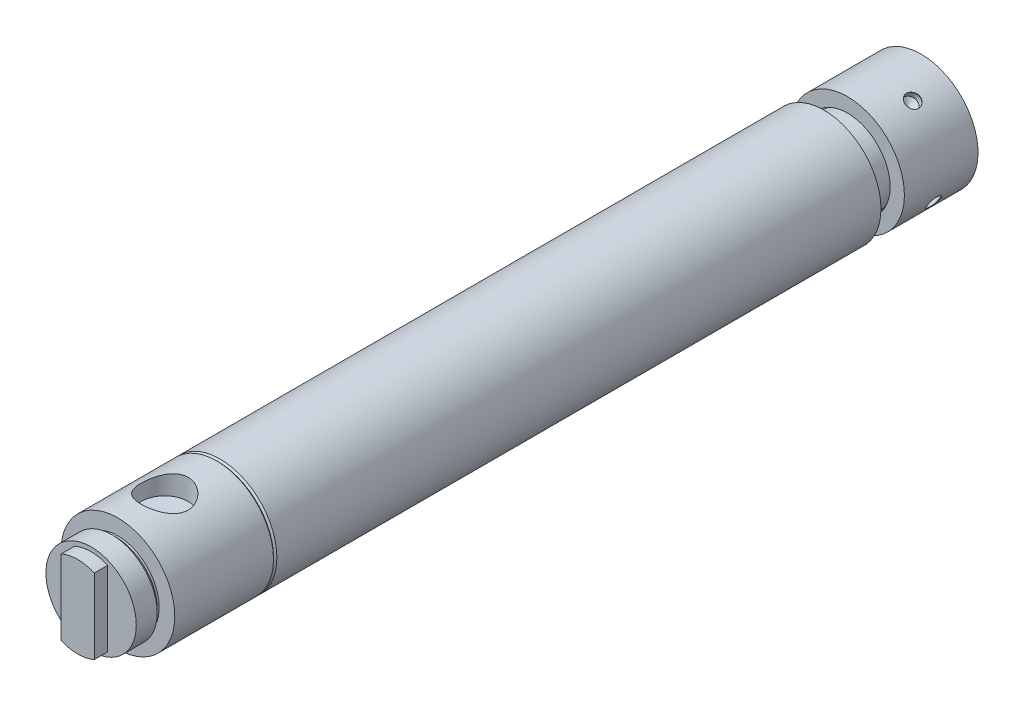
ISO-10303-21;
HEADER;
FILE_DESCRIPTION(('STEP AP214'),'2;1');
FILE_NAME('part.step','',(''),(''),'','','');
FILE_SCHEMA(('AUTOMOTIVE_DESIGN { 1 0 10303 214 1 1 1 1 }'));
ENDSEC;
DATA;
#1=APPLICATION_CONTEXT('core data for automotive mechanical design processes');
#2=APPLICATION_PROTOCOL_DEFINITION('international standard','automotive_design',2000,#1);
#3=PRODUCT_CONTEXT('',#1,'mechanical');
#4=PRODUCT('Part','Part','',(#3));
#5=PRODUCT_RELATED_PRODUCT_CATEGORY('part','',(#4));
#6=PRODUCT_DEFINITION_FORMATION('','',#4);
#7=PRODUCT_DEFINITION_CONTEXT('part definition',#1,'design');
#8=PRODUCT_DEFINITION('design','',#6,#7);
#9=PRODUCT_DEFINITION_SHAPE('','',#8);
#10=(LENGTH_UNIT() NAMED_UNIT(*) SI_UNIT(.MILLI.,.METRE.));
#11=(NAMED_UNIT(*) PLANE_ANGLE_UNIT() SI_UNIT($,.RADIAN.));
#12=(NAMED_UNIT(*) SI_UNIT($,.STERADIAN.) SOLID_ANGLE_UNIT());
#13=UNCERTAINTY_MEASURE_WITH_UNIT(LENGTH_MEASURE(1.E-05),#10,'distance_accuracy_value','');
#14=(GEOMETRIC_REPRESENTATION_CONTEXT(3) GLOBAL_UNCERTAINTY_ASSIGNED_CONTEXT((#13)) GLOBAL_UNIT_ASSIGNED_CONTEXT((#10,
#11,#12)) REPRESENTATION_CONTEXT('',''));
#15=CARTESIAN_POINT('',(0.,0.,0.));
#16=DIRECTION('',(0.,0.,1.));
#17=DIRECTION('',(1.,0.,0.));
#18=AXIS2_PLACEMENT_3D('',#15,#16,#17);
#19=CARTESIAN_POINT('',(4.95430548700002,12.397,252.));
#20=DIRECTION('',(0.,0.,-1.));
#21=DIRECTION('',(0.,-1.,0.));
#22=AXIS2_PLACEMENT_3D('',#19,#20,#21);
#23=PLANE('',#22);
#24=DIRECTION('',(0.,-1.,0.));
#25=VECTOR('',#24,1.);
#26=CARTESIAN_POINT('',(-4.94569451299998,0.,252.));
#27=LINE('',#26,#25);
#28=CARTESIAN_POINT('',(-4.94569451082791,11.2072568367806,252.));
#29=VERTEX_POINT('',#28);
#30=CARTESIAN_POINT('',(-4.94569451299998,-11.2072568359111,252.));
#31=VERTEX_POINT('',#30);
#32=EDGE_CURVE('E200',#29,#31,#27,.T.);
#33=ORIENTED_EDGE('',*,*,#32,.T.);
#34=CARTESIAN_POINT('',(0.,0.,252.));
#35=DIRECTION('',(0.,0.,1.));
#36=DIRECTION('',(1.,0.,0.));
#37=AXIS2_PLACEMENT_3D('',#34,#35,#36);
#38=CIRCLE('',#37,12.25);
#39=CARTESIAN_POINT('',(4.95430548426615,-11.2034529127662,252.));
#40=VERTEX_POINT('',#39);
#41=EDGE_CURVE('E18',#31,#40,#38,.T.);
#42=ORIENTED_EDGE('',*,*,#41,.T.);
#43=DIRECTION('',(0.,1.,0.));
#44=VECTOR('',#43,1.);
#45=CARTESIAN_POINT('',(4.95430548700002,0.,252.));
#46=LINE('',#45,#44);
#47=CARTESIAN_POINT('',(4.95430548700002,11.2034529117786,252.));
#48=VERTEX_POINT('',#47);
#49=EDGE_CURVE('E177',#40,#48,#46,.T.);
#50=ORIENTED_EDGE('',*,*,#49,.T.);
#51=CARTESIAN_POINT('',(0.,0.,252.));
#52=DIRECTION('',(0.,0.,1.));
#53=DIRECTION('',(1.,0.,0.));
#54=AXIS2_PLACEMENT_3D('',#51,#52,#53);
#55=CIRCLE('',#54,12.25);
#56=EDGE_CURVE('E184',#48,#29,#55,.T.);
#57=ORIENTED_EDGE('',*,*,#56,.T.);
#58=EDGE_LOOP('',(#33,#42,#50,#57));
#59=FACE_BOUND('',#58,.T.);
#60=ADVANCED_FACE('F14',(#59),#23,.F.);
#61=CARTESIAN_POINT('',(4.95430548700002,-11.203452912,252.));
#62=DIRECTION('',(-1.,0.,0.));
#63=DIRECTION('',(0.,1.,0.));
#64=AXIS2_PLACEMENT_3D('',#61,#62,#63);
#65=PLANE('',#64);
#66=DIRECTION('',(0.,-1.,0.));
#67=VECTOR('',#66,1.);
#68=CARTESIAN_POINT('',(4.95430548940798,0.,248.));
#69=LINE('',#68,#67);
#70=CARTESIAN_POINT('',(4.954305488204,11.2034529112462,248.));
#71=VERTEX_POINT('',#70);
#72=CARTESIAN_POINT('',(4.95430548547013,-11.2034529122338,248.));
#73=VERTEX_POINT('',#72);
#74=EDGE_CURVE('E195',#71,#73,#69,.T.);
#75=ORIENTED_EDGE('',*,*,#74,.F.);
#76=DIRECTION('',(0.,0.,-1.));
#77=VECTOR('',#76,1.);
#78=CARTESIAN_POINT('',(4.95430548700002,11.203452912,250.));
#79=LINE('',#78,#77);
#80=EDGE_CURVE('E187',#48,#71,#79,.T.);
#81=ORIENTED_EDGE('',*,*,#80,.F.);
#82=ORIENTED_EDGE('',*,*,#49,.F.);
#83=DIRECTION('',(0.,0.,1.));
#84=VECTOR('',#83,1.);
#85=CARTESIAN_POINT('',(4.95430548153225,-11.2034529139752,250.));
#86=LINE('',#85,#84);
#87=EDGE_CURVE('E554',#40,#73,#86,.F.);
#88=ORIENTED_EDGE('',*,*,#87,.T.);
#89=EDGE_LOOP('',(#75,#81,#82,#88));
#90=FACE_BOUND('',#89,.T.);
#91=ADVANCED_FACE('F194',(#90),#65,.F.);
#92=CARTESIAN_POINT('',(0.,0.,248.));
#93=DIRECTION('',(0.,0.,1.));
#94=DIRECTION('',(1.,0.,0.));
#95=AXIS2_PLACEMENT_3D('',#92,#93,#94);
#96=CYLINDRICAL_SURFACE('',#95,12.25);
#97=ORIENTED_EDGE('',*,*,#41,.F.);
#98=DIRECTION('',(0.,0.,-1.));
#99=VECTOR('',#98,1.);
#100=CARTESIAN_POINT('',(-4.94569451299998,-11.207256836,250.));
#101=LINE('',#100,#99);
#102=CARTESIAN_POINT('',(-4.94569451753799,-11.2072568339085,248.));
#103=VERTEX_POINT('',#102);
#104=EDGE_CURVE('E193',#31,#103,#101,.T.);
#105=ORIENTED_EDGE('',*,*,#104,.T.);
#106=CARTESIAN_POINT('',(0.,0.,248.));
#107=DIRECTION('',(0.,0.,1.));
#108=DIRECTION('',(1.,0.,0.));
#109=AXIS2_PLACEMENT_3D('',#106,#107,#108);
#110=CIRCLE('',#109,12.25);
#111=EDGE_CURVE('E563',#73,#103,#110,.F.);
#112=ORIENTED_EDGE('',*,*,#111,.F.);
#113=ORIENTED_EDGE('',*,*,#87,.F.);
#114=EDGE_LOOP('',(#97,#105,#112,#113));
#115=FACE_BOUND('',#114,.T.);
#116=ADVANCED_FACE('F562',(#115),#96,.T.);
#117=CARTESIAN_POINT('',(-4.94569451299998,11.207256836,252.));
#118=DIRECTION('',(1.,0.,0.));
#119=DIRECTION('',(0.,-1.,0.));
#120=AXIS2_PLACEMENT_3D('',#117,#118,#119);
#121=PLANE('',#120);
#122=DIRECTION('',(0.,1.,0.));
#123=VECTOR('',#122,1.);
#124=CARTESIAN_POINT('',(-4.94569452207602,0.,248.));
#125=LINE('',#124,#123);
#126=CARTESIAN_POINT('',(-4.94569451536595,11.207256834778,248.));
#127=VERTEX_POINT('',#126);
#128=EDGE_CURVE('E560',#103,#127,#125,.T.);
#129=ORIENTED_EDGE('',*,*,#128,.F.);
#130=ORIENTED_EDGE('',*,*,#104,.F.);
#131=ORIENTED_EDGE('',*,*,#32,.F.);
#132=DIRECTION('',(0.,0.,1.));
#133=VECTOR('',#132,1.);
#134=CARTESIAN_POINT('',(-4.94569450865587,11.2072568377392,250.));
#135=LINE('',#134,#133);
#136=EDGE_CURVE('E190',#29,#127,#135,.F.);
#137=ORIENTED_EDGE('',*,*,#136,.T.);
#138=EDGE_LOOP('',(#129,#130,#131,#137));
#139=FACE_BOUND('',#138,.T.);
#140=ADVANCED_FACE('F559',(#139),#121,.F.);
#141=CARTESIAN_POINT('',(0.,0.,248.));
#142=DIRECTION('',(0.,0.,1.));
#143=DIRECTION('',(1.,0.,0.));
#144=AXIS2_PLACEMENT_3D('',#141,#142,#143);
#145=CYLINDRICAL_SURFACE('',#144,12.25);
#146=CARTESIAN_POINT('',(0.,0.,248.));
#147=DIRECTION('',(0.,0.,1.));
#148=DIRECTION('',(1.,0.,0.));
#149=AXIS2_PLACEMENT_3D('',#146,#147,#148);
#150=CIRCLE('',#149,12.25);
#151=EDGE_CURVE('E566',#127,#71,#150,.F.);
#152=ORIENTED_EDGE('',*,*,#151,.F.);
#153=ORIENTED_EDGE('',*,*,#136,.F.);
#154=ORIENTED_EDGE('',*,*,#56,.F.);
#155=ORIENTED_EDGE('',*,*,#80,.T.);
#156=EDGE_LOOP('',(#152,#153,#154,#155));
#157=FACE_BOUND('',#156,.T.);
#158=ADVANCED_FACE('F186',(#157),#145,.T.);
#159=CARTESIAN_POINT('',(13.662,-13.662,248.));
#160=DIRECTION('',(0.,0.,1.));
#161=DIRECTION('',(0.,1.,0.));
#162=AXIS2_PLACEMENT_3D('',#159,#160,#161);
#163=PLANE('',#162);
#164=ORIENTED_EDGE('',*,*,#128,.T.);
#165=ORIENTED_EDGE('',*,*,#151,.T.);
#166=ORIENTED_EDGE('',*,*,#74,.T.);
#167=ORIENTED_EDGE('',*,*,#111,.T.);
#168=EDGE_LOOP('',(#164,#165,#166,#167));
#169=FACE_BOUND('',#168,.T.);
#170=CARTESIAN_POINT('',(0.,0.,248.));
#171=DIRECTION('',(0.,0.,1.));
#172=DIRECTION('',(1.,0.,0.));
#173=AXIS2_PLACEMENT_3D('',#170,#171,#172);
#174=CIRCLE('',#173,13.5);
#175=CARTESIAN_POINT('',(13.5,0.,248.));
#176=VERTEX_POINT('',#175);
#177=EDGE_CURVE('E550',#176,#176,#174,.T.);
#178=ORIENTED_EDGE('',*,*,#177,.T.);
#179=EDGE_LOOP('',(#178));
#180=FACE_BOUND('',#179,.T.);
#181=ADVANCED_FACE('F724',(#169,#180),#163,.T.);
#182=CARTESIAN_POINT('',(0.,0.,241.75));
#183=DIRECTION('',(0.,0.,1.));
#184=DIRECTION('',(1.,0.,0.));
#185=AXIS2_PLACEMENT_3D('',#182,#183,#184);
#186=CYLINDRICAL_SURFACE('',#185,13.5);
#187=CARTESIAN_POINT('',(0.,0.,241.75));
#188=DIRECTION('',(0.,0.,1.));
#189=DIRECTION('',(0.,1.,0.));
#190=AXIS2_PLACEMENT_3D('',#187,#188,#189);
#191=CIRCLE('',#190,13.5);
#192=CARTESIAN_POINT('',(0.,13.5,241.75));
#193=VERTEX_POINT('',#192);
#194=EDGE_CURVE('E547',#193,#193,#191,.T.);
#195=ORIENTED_EDGE('',*,*,#194,.T.);
#196=EDGE_LOOP('',(#195));
#197=FACE_BOUND('',#196,.T.);
#198=ORIENTED_EDGE('',*,*,#177,.F.);
#199=EDGE_LOOP('',(#198));
#200=FACE_BOUND('',#199,.T.);
#201=ADVANCED_FACE('F727',(#197,#200),#186,.T.);
#202=CARTESIAN_POINT('',(0.,0.,240.6));
#203=DIRECTION('',(0.,0.,1.));
#204=DIRECTION('',(1.,0.,0.));
#205=AXIS2_PLACEMENT_3D('',#202,#203,#204);
#206=CONICAL_SURFACE('',#205,12.35,0.785398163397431);
#207=CARTESIAN_POINT('',(0.,0.,240.6));
#208=DIRECTION('',(0.,0.,-1.));
#209=DIRECTION('',(0.,-1.,0.));
#210=AXIS2_PLACEMENT_3D('',#207,#208,#209);
#211=CIRCLE('',#210,12.35);
#212=CARTESIAN_POINT('',(0.,-12.35,240.6));
#213=VERTEX_POINT('',#212);
#214=EDGE_CURVE('E544',#213,#213,#211,.F.);
#215=ORIENTED_EDGE('',*,*,#214,.T.);
#216=EDGE_LOOP('',(#215));
#217=FACE_BOUND('',#216,.T.);
#218=ORIENTED_EDGE('',*,*,#194,.F.);
#219=EDGE_LOOP('',(#218));
#220=FACE_BOUND('',#219,.T.);
#221=ADVANCED_FACE('F1149',(#217,#220),#206,.T.);
#222=CARTESIAN_POINT('',(0.,0.,88.557960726));
#223=DIRECTION('',(0.,0.,-1.));
#224=DIRECTION('',(-1.,0.,0.));
#225=AXIS2_PLACEMENT_3D('',#222,#223,#224);
#226=CONICAL_SURFACE('',#225,0.,1.02974425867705);
#227=CARTESIAN_POINT('',(0.,0.,88.557960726));
#228=VERTEX_POINT('',#227);
#229=VERTEX_LOOP('',#228);
#230=FACE_BOUND('',#229,.T.);
#231=CARTESIAN_POINT('',(0.,0.,83.));
#232=DIRECTION('',(0.,0.,-1.));
#233=DIRECTION('',(0.,-1.,0.));
#234=AXIS2_PLACEMENT_3D('',#231,#232,#233);
#235=CIRCLE('',#234,9.25);
#236=CARTESIAN_POINT('',(0.,-9.25,83.));
#237=VERTEX_POINT('',#236);
#238=EDGE_CURVE('E540',#237,#237,#235,.F.);
#239=ORIENTED_EDGE('',*,*,#238,.F.);
#240=EDGE_LOOP('',(#239));
#241=FACE_BOUND('',#240,.T.);
#242=ADVANCED_FACE('F732',(#230,#241),#226,.F.);
#243=CARTESIAN_POINT('',(7.084,10.75,218.916));
#244=DIRECTION('',(0.,-1.,0.));
#245=DIRECTION('',(0.,0.,1.));
#246=AXIS2_PLACEMENT_3D('',#243,#244,#245);
#247=PLANE('',#246);
#248=CARTESIAN_POINT('',(0.,10.75,226.));
#249=DIRECTION('',(0.,1.,0.));
#250=DIRECTION('',(-1.,0.,0.));
#251=AXIS2_PLACEMENT_3D('',#248,#249,#250);
#252=CIRCLE('',#251,7.);
#253=CARTESIAN_POINT('',(-7.,10.75,226.));
#254=VERTEX_POINT('',#253);
#255=EDGE_CURVE('E543',#254,#254,#252,.F.);
#256=ORIENTED_EDGE('',*,*,#255,.F.);
#257=EDGE_LOOP('',(#256));
#258=FACE_BOUND('',#257,.T.);
#259=ADVANCED_FACE('F728',(#258),#247,.F.);
#260=CARTESIAN_POINT('',(0.,0.,240.6));
#261=DIRECTION('',(0.,0.,-1.));
#262=DIRECTION('',(-1.,0.,0.));
#263=AXIS2_PLACEMENT_3D('',#260,#261,#262);
#264=CYLINDRICAL_SURFACE('',#263,12.35);
#265=ORIENTED_EDGE('',*,*,#214,.F.);
#266=EDGE_LOOP('',(#265));
#267=FACE_BOUND('',#266,.T.);
#268=CARTESIAN_POINT('',(0.,0.,240.));
#269=DIRECTION('',(0.,0.,-1.));
#270=DIRECTION('',(-1.,0.,0.));
#271=AXIS2_PLACEMENT_3D('',#268,#269,#270);
#272=CIRCLE('',#271,12.35);
#273=CARTESIAN_POINT('',(-12.35,0.,240.));
#274=VERTEX_POINT('',#273);
#275=EDGE_CURVE('E575',#274,#274,#272,.T.);
#276=ORIENTED_EDGE('',*,*,#275,.F.);
#277=EDGE_LOOP('',(#276));
#278=FACE_BOUND('',#277,.T.);
#279=ADVANCED_FACE('F731',(#267,#278),#264,.T.);
#280=CARTESIAN_POINT('',(-7.084,-10.75,233.084));
#281=DIRECTION('',(0.,1.,0.));
#282=DIRECTION('',(1.,0.,0.));
#283=AXIS2_PLACEMENT_3D('',#280,#281,#282);
#284=PLANE('',#283);
#285=CARTESIAN_POINT('',(0.,-10.75,226.));
#286=DIRECTION('',(0.,-1.,0.));
#287=DIRECTION('',(0.,0.,1.));
#288=AXIS2_PLACEMENT_3D('',#285,#286,#287);
#289=CIRCLE('',#288,7.);
#290=CARTESIAN_POINT('',(0.,-10.75,233.));
#291=VERTEX_POINT('',#290);
#292=EDGE_CURVE('E533',#291,#291,#289,.F.);
#293=ORIENTED_EDGE('',*,*,#292,.F.);
#294=EDGE_LOOP('',(#293));
#295=FACE_BOUND('',#294,.T.);
#296=ADVANCED_FACE('F734',(#295),#284,.F.);
#297=CARTESIAN_POINT('',(0.,0.,83.));
#298=DIRECTION('',(0.,0.,-1.));
#299=DIRECTION('',(-1.,0.,0.));
#300=AXIS2_PLACEMENT_3D('',#297,#298,#299);
#301=CYLINDRICAL_SURFACE('',#300,9.25);
#302=ORIENTED_EDGE('',*,*,#238,.T.);
#303=EDGE_LOOP('',(#302));
#304=FACE_BOUND('',#303,.T.);
#305=DIRECTION('',(0.,0.,1.));
#306=VECTOR('',#305,1.);
#307=CARTESIAN_POINT('',(-5.05,7.749838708,10.25));
#308=LINE('',#307,#306);
#309=CARTESIAN_POINT('',(-5.05,7.74983870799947,8.));
#310=VERTEX_POINT('',#309);
#311=CARTESIAN_POINT('',(-5.05,7.74983870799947,12.5));
#312=VERTEX_POINT('',#311);
#313=EDGE_CURVE('E503',#310,#312,#308,.T.);
#314=ORIENTED_EDGE('',*,*,#313,.T.);
#315=CARTESIAN_POINT('',(1.11022302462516E-13,0.,12.5));
#316=DIRECTION('',(0.,0.,-1.));
#317=DIRECTION('',(-1.,0.,0.));
#318=AXIS2_PLACEMENT_3D('',#315,#316,#317);
#319=CIRCLE('',#318,9.25);
#320=CARTESIAN_POINT('',(5.05,7.74983870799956,12.5));
#321=VERTEX_POINT('',#320);
#322=EDGE_CURVE('E583',#321,#312,#319,.F.);
#323=ORIENTED_EDGE('',*,*,#322,.F.);
#324=DIRECTION('',(0.,0.,-1.));
#325=VECTOR('',#324,1.);
#326=CARTESIAN_POINT('',(5.05,7.749838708,10.25));
#327=LINE('',#326,#325);
#328=CARTESIAN_POINT('',(5.05,7.74983870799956,8.));
#329=VERTEX_POINT('',#328);
#330=EDGE_CURVE('E529',#321,#329,#327,.T.);
#331=ORIENTED_EDGE('',*,*,#330,.T.);
#332=CARTESIAN_POINT('',(1.11022302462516E-13,0.,8.));
#333=DIRECTION('',(0.,0.,-1.));
#334=DIRECTION('',(-1.,0.,0.));
#335=AXIS2_PLACEMENT_3D('',#332,#333,#334);
#336=CIRCLE('',#335,9.25);
#337=CARTESIAN_POINT('',(5.05,-7.74983870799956,8.));
#338=VERTEX_POINT('',#337);
#339=EDGE_CURVE('E532',#338,#329,#336,.F.);
#340=ORIENTED_EDGE('',*,*,#339,.F.);
#341=DIRECTION('',(0.,0.,1.));
#342=VECTOR('',#341,1.);
#343=CARTESIAN_POINT('',(5.05,-7.749838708,10.25));
#344=LINE('',#343,#342);
#345=CARTESIAN_POINT('',(5.05,-7.74983870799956,12.5));
#346=VERTEX_POINT('',#345);
#347=EDGE_CURVE('E521',#338,#346,#344,.T.);
#348=ORIENTED_EDGE('',*,*,#347,.T.);
#349=CARTESIAN_POINT('',(1.11022302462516E-13,0.,12.5));
#350=DIRECTION('',(0.,0.,-1.));
#351=DIRECTION('',(-1.,0.,0.));
#352=AXIS2_PLACEMENT_3D('',#349,#350,#351);
#353=CIRCLE('',#352,9.25);
#354=CARTESIAN_POINT('',(-5.05,-7.74983870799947,12.5));
#355=VERTEX_POINT('',#354);
#356=EDGE_CURVE('E520',#355,#346,#353,.F.);
#357=ORIENTED_EDGE('',*,*,#356,.F.);
#358=DIRECTION('',(0.,0.,-1.));
#359=VECTOR('',#358,1.);
#360=CARTESIAN_POINT('',(-5.05,-7.749838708,10.25));
#361=LINE('',#360,#359);
#362=CARTESIAN_POINT('',(-5.05,-7.74983870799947,8.));
#363=VERTEX_POINT('',#362);
#364=EDGE_CURVE('E512',#355,#363,#361,.T.);
#365=ORIENTED_EDGE('',*,*,#364,.T.);
#366=CARTESIAN_POINT('',(1.11022302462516E-13,0.,8.));
#367=DIRECTION('',(0.,0.,-1.));
#368=DIRECTION('',(-1.,0.,0.));
#369=AXIS2_PLACEMENT_3D('',#366,#367,#368);
#370=CIRCLE('',#369,9.25);
#371=EDGE_CURVE('E511',#310,#363,#370,.F.);
#372=ORIENTED_EDGE('',*,*,#371,.F.);
#373=EDGE_LOOP('',(#314,#323,#331,#340,#348,#357,#365,#372));
#374=FACE_BOUND('',#373,.T.);
#375=ADVANCED_FACE('F603',(#304,#374),#301,.F.);
#376=CARTESIAN_POINT('',(0.,10.75,226.));
#377=DIRECTION('',(0.,1.,0.));
#378=DIRECTION('',(-1.,0.,0.));
#379=AXIS2_PLACEMENT_3D('',#376,#377,#378);
#380=CYLINDRICAL_SURFACE('',#379,7.);
#381=ORIENTED_EDGE('',*,*,#255,.T.);
#382=EDGE_LOOP('',(#381));
#383=FACE_BOUND('',#382,.T.);
#384=CARTESIAN_POINT('',(1.01765817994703E-09,17.0000000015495,218.99999999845));
#385=CARTESIAN_POINT('',(-0.187947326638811,17.0000009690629,218.999998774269));
#386=CARTESIAN_POINT('',(-0.3758780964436,16.9968766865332,219.007575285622));
#387=CARTESIAN_POINT('',(-0.750382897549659,16.9844643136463,219.037800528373));
#388=CARTESIAN_POINT('',(-0.93695649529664,16.9751743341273,219.0604538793));
#389=CARTESIAN_POINT('',(-1.30748129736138,16.9506638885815,219.120627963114));
#390=CARTESIAN_POINT('',(-1.49142967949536,16.9354374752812,219.158163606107));
#391=CARTESIAN_POINT('',(-1.85527910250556,16.8994489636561,219.247736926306));
#392=CARTESIAN_POINT('',(-2.03517852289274,16.8786846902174,219.299780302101));
#393=CARTESIAN_POINT('',(-2.38905955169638,16.8322351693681,219.417670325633));
#394=CARTESIAN_POINT('',(-2.5630588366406,16.8065665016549,219.483470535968));
#395=CARTESIAN_POINT('',(-2.90475171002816,16.7508923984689,219.628432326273));
#396=CARTESIAN_POINT('',(-3.07244288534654,16.7208853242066,219.707598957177));
#397=CARTESIAN_POINT('',(-3.40041673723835,16.6572825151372,219.878614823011));
#398=CARTESIAN_POINT('',(-3.56070252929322,16.6236883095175,219.970458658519));
#399=CARTESIAN_POINT('',(-3.87313911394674,16.5536834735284,220.166236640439));
#400=CARTESIAN_POINT('',(-4.02528692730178,16.5172718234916,220.270175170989));
#401=CARTESIAN_POINT('',(-4.32722150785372,16.4408174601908,220.494359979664));
#402=CARTESIAN_POINT('',(-4.47659867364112,16.4006851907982,220.615127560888));
#403=CARTESIAN_POINT('',(-4.7647653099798,16.3192963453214,220.86835249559));
#404=CARTESIAN_POINT('',(-4.90355439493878,16.2780397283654,221.000810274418));
#405=CARTESIAN_POINT('',(-5.16986842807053,16.1954287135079,221.276733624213));
#406=CARTESIAN_POINT('',(-5.29738671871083,16.1540742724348,221.420205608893));
#407=CARTESIAN_POINT('',(-5.54029961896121,16.0723831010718,221.717257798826));
#408=CARTESIAN_POINT('',(-5.65569823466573,16.0320460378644,221.8708346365));
#409=CARTESIAN_POINT('',(-5.87897989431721,15.9515627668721,222.194980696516));
#410=CARTESIAN_POINT('',(-5.98623013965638,15.9115200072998,222.366012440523));
#411=CARTESIAN_POINT('',(-6.1858148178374,15.8349966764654,222.717245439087));
#412=CARTESIAN_POINT('',(-6.27815493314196,15.7985147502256,222.897443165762));
#413=CARTESIAN_POINT('',(-6.44714733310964,15.7303082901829,223.265889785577));
#414=CARTESIAN_POINT('',(-6.52380231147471,15.6985829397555,223.454137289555));
#415=CARTESIAN_POINT('',(-6.66066886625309,15.641004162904,223.837389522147));
#416=CARTESIAN_POINT('',(-6.7208816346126,15.6151503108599,224.032393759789));
#417=CARTESIAN_POINT('',(-6.82173895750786,15.5713441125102,224.418307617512));
#418=CARTESIAN_POINT('',(-6.86317433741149,15.5530758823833,224.608974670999));
#419=CARTESIAN_POINT('',(-6.93002836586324,15.523403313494,224.993618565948));
#420=CARTESIAN_POINT('',(-6.95544826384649,15.5119984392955,225.187595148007));
#421=CARTESIAN_POINT('',(-6.98995514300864,15.4964798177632,225.577202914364));
#422=CARTESIAN_POINT('',(-6.99904920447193,15.4923629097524,225.77283334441));
#423=CARTESIAN_POINT('',(-7.00080909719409,15.4915678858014,226.16417829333));
#424=CARTESIAN_POINT('',(-6.99347576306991,15.4948893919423,226.359892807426));
#425=CARTESIAN_POINT('',(-6.96364006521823,15.5083188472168,226.735155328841));
#426=CARTESIAN_POINT('',(-6.94231375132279,15.5179004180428,226.914817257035));
#427=CARTESIAN_POINT('',(-6.88590239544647,15.5430145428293,227.271604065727));
#428=CARTESIAN_POINT('',(-6.85081293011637,15.5585490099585,227.448728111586));
#429=CARTESIAN_POINT('',(-6.76723494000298,15.5950827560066,227.799159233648));
#430=CARTESIAN_POINT('',(-6.7187494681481,15.6160807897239,227.972467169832));
#431=CARTESIAN_POINT('',(-6.60879942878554,15.6629287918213,228.31430788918));
#432=CARTESIAN_POINT('',(-6.54732986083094,15.6887806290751,228.482838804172));
#433=CARTESIAN_POINT('',(-6.41053024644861,15.7451797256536,228.817526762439));
#434=CARTESIAN_POINT('',(-6.33494022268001,15.7758129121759,228.983562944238));
#435=CARTESIAN_POINT('',(-6.17132808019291,15.8405318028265,229.308754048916));
#436=CARTESIAN_POINT('',(-6.08330175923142,15.8746186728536,229.467906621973));
#437=CARTESIAN_POINT('',(-5.89541835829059,15.9453477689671,229.778490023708));
#438=CARTESIAN_POINT('',(-5.79556003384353,15.9819902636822,229.92992003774));
#439=CARTESIAN_POINT('',(-5.58461468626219,16.056917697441,230.224319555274));
#440=CARTESIAN_POINT('',(-5.47352704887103,16.0952027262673,230.36728859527));
#441=CARTESIAN_POINT('',(-5.2311171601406,16.1756927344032,230.655505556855));
#442=CARTESIAN_POINT('',(-5.09888170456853,16.2179606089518,230.799969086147));
#443=CARTESIAN_POINT('',(-4.82277514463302,16.3021981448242,231.077314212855));
#444=CARTESIAN_POINT('',(-4.67890743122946,16.3441678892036,231.210199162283));
#445=CARTESIAN_POINT('',(-4.38017648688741,16.4267490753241,231.463741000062));
#446=CARTESIAN_POINT('',(-4.22530376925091,16.4673592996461,231.584387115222));
#447=CARTESIAN_POINT('',(-3.90561224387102,16.5460956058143,231.812463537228));
#448=CARTESIAN_POINT('',(-3.74079744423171,16.58422267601,231.919899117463));
#449=CARTESIAN_POINT('',(-3.39819201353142,16.6578417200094,232.123142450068));
#450=CARTESIAN_POINT('',(-3.22018900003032,16.6932519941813,232.218622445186));
#451=CARTESIAN_POINT('',(-2.85595902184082,16.7594074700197,232.394086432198));
#452=CARTESIAN_POINT('',(-2.66973562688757,16.7901546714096,232.474077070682));
#453=CARTESIAN_POINT('',(-2.29059421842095,16.8460628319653,232.617719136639));
#454=CARTESIAN_POINT('',(-2.09768671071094,16.8712321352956,232.68139499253));
#455=CARTESIAN_POINT('',(-1.70647713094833,16.9152790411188,232.791850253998));
#456=CARTESIAN_POINT('',(-1.50817737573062,16.9341593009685,232.838636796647));
#457=CARTESIAN_POINT('',(-1.09294194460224,16.9662005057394,232.917612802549));
#458=CARTESIAN_POINT('',(-0.875710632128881,16.978836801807,232.948470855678));
#459=CARTESIAN_POINT('',(-0.438978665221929,16.9957359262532,232.989663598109));
#460=CARTESIAN_POINT('',(-0.219478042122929,16.9999988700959,232.999998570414));
#461=CARTESIAN_POINT('',(0.187947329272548,17.0000009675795,233.000001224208));
#462=CARTESIAN_POINT('',(0.37587809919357,16.9968766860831,232.992424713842));
#463=CARTESIAN_POINT('',(0.750382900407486,16.9844643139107,232.96219947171));
#464=CARTESIAN_POINT('',(0.936956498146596,16.9751743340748,232.93954612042));
#465=CARTESIAN_POINT('',(1.30748130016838,16.9506638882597,232.879372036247));
#466=CARTESIAN_POINT('',(1.49142968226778,16.9354374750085,232.84183639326));
#467=CARTESIAN_POINT('',(1.85527910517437,16.8994489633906,232.752263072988));
#468=CARTESIAN_POINT('',(2.03517852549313,16.8786846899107,232.700219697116));
#469=CARTESIAN_POINT('',(2.38905955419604,16.8322351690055,232.582329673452));
#470=CARTESIAN_POINT('',(2.56305883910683,16.8065665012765,232.516529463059));
#471=CARTESIAN_POINT('',(2.90475171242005,16.7508923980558,232.371567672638));
#472=CARTESIAN_POINT('',(3.07244288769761,16.7208853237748,232.292401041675));
#473=CARTESIAN_POINT('',(3.40041673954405,16.657282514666,232.121385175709));
#474=CARTESIAN_POINT('',(3.56070253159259,16.6236883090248,232.029541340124));
#475=CARTESIAN_POINT('',(3.87313911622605,16.5536834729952,231.833763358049));
#476=CARTESIAN_POINT('',(4.02528692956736,16.5172718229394,231.72982482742));
#477=CARTESIAN_POINT('',(4.32722151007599,16.4408174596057,231.50564001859));
#478=CARTESIAN_POINT('',(4.476598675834,16.4006851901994,231.38487243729));
#479=CARTESIAN_POINT('',(4.76476531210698,16.3192963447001,231.131647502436));
#480=CARTESIAN_POINT('',(4.90355439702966,16.2780397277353,230.999189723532));
#481=CARTESIAN_POINT('',(5.16986843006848,16.1954287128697,230.7232663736));
#482=CARTESIAN_POINT('',(5.29738672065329,16.1540742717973,230.579794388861));
#483=CARTESIAN_POINT('',(5.54029962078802,16.0723831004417,230.282742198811));
#484=CARTESIAN_POINT('',(5.65569823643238,16.0320460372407,230.129165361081));
#485=CARTESIAN_POINT('',(5.8789798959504,15.9515627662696,229.80501930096));
#486=CARTESIAN_POINT('',(5.9862301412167,15.9115200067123,229.633987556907));
#487=CARTESIAN_POINT('',(6.18581481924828,15.8349966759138,229.282754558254));
#488=CARTESIAN_POINT('',(6.27815493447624,15.7985147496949,229.102556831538));
#489=CARTESIAN_POINT('',(6.44714733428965,15.7303082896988,228.734110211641));
#490=CARTESIAN_POINT('',(6.52380231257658,15.6985829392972,228.545862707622));
#491=CARTESIAN_POINT('',(6.66066886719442,15.6410041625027,228.162610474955));
#492=CARTESIAN_POINT('',(6.72088163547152,15.6151503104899,227.967606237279));
#493=CARTESIAN_POINT('',(6.82173895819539,15.5713441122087,227.581692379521));
#494=CARTESIAN_POINT('',(6.86317433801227,15.553075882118,227.391025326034));
#495=CARTESIAN_POINT('',(6.93002836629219,15.5234033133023,227.006381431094));
#496=CARTESIAN_POINT('',(6.95544826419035,15.5119984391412,226.812404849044));
#497=CARTESIAN_POINT('',(6.98995514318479,15.4964798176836,226.422797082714));
#498=CARTESIAN_POINT('',(6.99904920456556,15.4923629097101,226.227166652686));
#499=CARTESIAN_POINT('',(7.00080909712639,15.491567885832,225.835821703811));
#500=CARTESIAN_POINT('',(6.99347576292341,15.4948893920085,225.640107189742));
#501=CARTESIAN_POINT('',(6.96364006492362,15.5083188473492,225.264844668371));
#502=CARTESIAN_POINT('',(6.94231375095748,15.5179004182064,225.085182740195));
#503=CARTESIAN_POINT('',(6.88590239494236,15.5430145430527,224.728395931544));
#504=CARTESIAN_POINT('',(6.85081292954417,15.5585490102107,224.551271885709));
#505=CARTESIAN_POINT('',(6.76723493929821,15.5950827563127,224.200840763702));
#506=CARTESIAN_POINT('',(6.718749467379,15.6160807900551,224.02753282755));
#507=CARTESIAN_POINT('',(6.60879942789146,15.6629287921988,223.685692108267));
#508=CARTESIAN_POINT('',(6.54732985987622,15.6887806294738,223.517161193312));
#509=CARTESIAN_POINT('',(6.41053024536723,15.7451797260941,223.1824732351));
#510=CARTESIAN_POINT('',(6.33494022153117,15.7758129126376,223.016437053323));
#511=CARTESIAN_POINT('',(6.17132807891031,15.8405318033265,222.691245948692));
#512=CARTESIAN_POINT('',(6.08330175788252,15.8746186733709,222.53209337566));
#513=CARTESIAN_POINT('',(5.89541835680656,15.9453477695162,222.221509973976));
#514=CARTESIAN_POINT('',(5.79556003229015,15.981990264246,222.070079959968));
#515=CARTESIAN_POINT('',(5.58461468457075,16.0569176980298,221.775680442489));
#516=CARTESIAN_POINT('',(5.47352704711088,16.0952027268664,221.632711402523));
#517=CARTESIAN_POINT('',(5.23111715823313,16.1756927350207,221.344494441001));
#518=CARTESIAN_POINT('',(5.09888170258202,16.2179606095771,221.200030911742));
#519=CARTESIAN_POINT('',(4.82277514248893,16.3021981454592,220.922685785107));
#520=CARTESIAN_POINT('',(4.67890742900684,16.3441678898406,220.78980083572));
#521=CARTESIAN_POINT('',(4.38017648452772,16.4267490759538,220.536258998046));
#522=CARTESIAN_POINT('',(4.22530376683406,16.4673593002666,220.415612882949));
#523=CARTESIAN_POINT('',(3.90561224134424,16.5460956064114,220.187536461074));
#524=CARTESIAN_POINT('',(3.74079744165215,16.5842226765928,220.080100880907));
#525=CARTESIAN_POINT('',(3.39819201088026,16.6578417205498,219.876857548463));
#526=CARTESIAN_POINT('',(3.22018899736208,16.693251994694,219.781377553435));
#527=CARTESIAN_POINT('',(2.85595901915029,16.7594074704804,219.605913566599));
#528=CARTESIAN_POINT('',(2.66973562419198,16.7901546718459,219.525922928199));
#529=CARTESIAN_POINT('',(2.29059421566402,16.8460628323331,219.382280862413));
#530=CARTESIAN_POINT('',(2.09768670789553,16.8712321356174,219.318605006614));
#531=CARTESIAN_POINT('',(1.70647712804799,16.9152790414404,219.208149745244));
#532=CARTESIAN_POINT('',(1.50817737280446,16.9341593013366,219.1613632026));
#533=CARTESIAN_POINT('',(1.09294194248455,16.96620050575,219.08238719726));
#534=CARTESIAN_POINT('',(0.875710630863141,16.9788368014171,219.051529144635));
#535=CARTESIAN_POINT('',(0.438978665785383,16.9957359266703,219.010336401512));
#536=CARTESIAN_POINT('',(0.219478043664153,16.9999988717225,219.000001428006));
#537=CARTESIAN_POINT('',(1.01765817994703E-09,17.0000000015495,218.99999999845));
#538=B_SPLINE_CURVE_WITH_KNOTS('',3,(#384,#385,#386,#387,#388,#389,#390,#391,#392,#393,#394,
#395,#396,#397,#398,#399,#400,#401,#402,#403,#404,#405,#406,#407,#408,#409,#410,#411,#412,#413,
#414,#415,#416,#417,#418,#419,#420,#421,#422,#423,#424,#425,#426,#427,#428,#429,#430,#431,#432,
#433,#434,#435,#436,#437,#438,#439,#440,#441,#442,#443,#444,#445,#446,#447,#448,#449,#450,#451,
#452,#453,#454,#455,#456,#457,#458,#459,#460,#461,#462,#463,#464,#465,#466,#467,#468,#469,#470,
#471,#472,#473,#474,#475,#476,#477,#478,#479,#480,#481,#482,#483,#484,#485,#486,#487,#488,#489,
#490,#491,#492,#493,#494,#495,#496,#497,#498,#499,#500,#501,#502,#503,#504,#505,#506,#507,#508,
#509,#510,#511,#512,#513,#514,#515,#516,#517,#518,#519,#520,#521,#522,#523,#524,#525,#526,#527,
#528,#529,#530,#531,#532,#533,#534,#535,#536,#537),.UNSPECIFIED.,.T.,.F.,(4,2,2,2,2,2,2,2,2,2,2,
2,2,2,2,2,2,2,2,2,2,2,2,2,2,2,2,2,2,2,2,2,2,2,2,2,2,2,2,2,2,2,2,2,2,2,2,2,2,2,2,2,2,2,2,2,2,2,2,
2,2,2,2,2,2,2,2,2,2,2,2,2,2,2,2,2,4),(0.,0.56363578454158,1.12744434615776,1.69181920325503,
2.25641605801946,2.81913697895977,3.38207102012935,3.94476603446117,4.50766565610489,
5.09572892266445,5.68381359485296,6.27224335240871,6.86047799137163,7.47714277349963,
8.09357197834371,8.70989523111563,9.32617379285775,9.91330405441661,10.5003885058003,
11.0872182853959,11.6740182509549,12.2169120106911,12.7599803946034,13.3029251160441,
13.8460793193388,14.400448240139,14.9550049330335,15.5096200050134,16.064265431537,
16.6646513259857,17.2648628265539,17.8655981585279,18.4660929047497,19.0805251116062,
19.6946930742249,20.3079359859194,20.920919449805,21.5791218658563,22.2373152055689,
22.8009509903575,23.3647595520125,23.9291344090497,24.4937312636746,25.0564521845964,
25.619386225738,26.1820812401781,26.7449808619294,27.3330441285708,27.9211288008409,
28.5095585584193,29.0977931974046,29.7144579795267,30.330887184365,30.94721043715,
31.5634889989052,32.1506192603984,32.7377037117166,33.324533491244,33.9113334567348,
34.4542272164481,34.9972956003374,35.5402403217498,36.0833945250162,36.6377634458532,
37.1923201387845,37.7469352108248,38.3015806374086,38.9019665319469,39.5021780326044,
40.1029133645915,40.7034081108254,41.3178403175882,41.9320082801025,42.5452511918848,
43.158234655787,43.8164370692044,44.4746304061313),.UNSPECIFIED.);
#539=CARTESIAN_POINT('',(1.01765817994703E-09,17.0000000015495,218.99999999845));
#540=VERTEX_POINT('',#539);
#541=EDGE_CURVE('E586',#540,#540,#538,.T.);
#542=ORIENTED_EDGE('',*,*,#541,.T.);
#543=EDGE_LOOP('',(#542));
#544=FACE_BOUND('',#543,.T.);
#545=ADVANCED_FACE('F598',(#383,#544),#380,.F.);
#546=CARTESIAN_POINT('',(17.204,-17.204,240.));
#547=DIRECTION('',(0.,0.,1.));
#548=DIRECTION('',(0.,1.,0.));
#549=AXIS2_PLACEMENT_3D('',#546,#547,#548);
#550=PLANE('',#549);
#551=ORIENTED_EDGE('',*,*,#275,.T.);
#552=EDGE_LOOP('',(#551));
#553=FACE_BOUND('',#552,.T.);
#554=CARTESIAN_POINT('',(0.,0.,240.));
#555=DIRECTION('',(0.,0.,1.));
#556=DIRECTION('',(1.,0.,0.));
#557=AXIS2_PLACEMENT_3D('',#554,#555,#556);
#558=CIRCLE('',#557,17.);
#559=CARTESIAN_POINT('',(17.,0.,240.));
#560=VERTEX_POINT('',#559);
#561=EDGE_CURVE('E593',#560,#560,#558,.T.);
#562=ORIENTED_EDGE('',*,*,#561,.T.);
#563=EDGE_LOOP('',(#562));
#564=FACE_BOUND('',#563,.T.);
#565=ADVANCED_FACE('F602',(#553,#564),#550,.T.);
#566=CARTESIAN_POINT('',(0.,-10.75,226.));
#567=DIRECTION('',(0.,-1.,0.));
#568=DIRECTION('',(0.,0.,1.));
#569=AXIS2_PLACEMENT_3D('',#566,#567,#568);
#570=CYLINDRICAL_SURFACE('',#569,7.);
#571=ORIENTED_EDGE('',*,*,#292,.T.);
#572=EDGE_LOOP('',(#571));
#573=FACE_BOUND('',#572,.T.);
#574=CARTESIAN_POINT('',(4.18409751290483E-09,-17.,233.));
#575=CARTESIAN_POINT('',(-0.188046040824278,-17.0000045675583,233.000005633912));
#576=CARTESIAN_POINT('',(-0.376035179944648,-16.9968751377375,232.992419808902));
#577=CARTESIAN_POINT('',(-0.75064652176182,-16.9844519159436,232.962170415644));
#578=CARTESIAN_POINT('',(-0.937268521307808,-16.9751572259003,232.939504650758));
#579=CARTESIAN_POINT('',(-1.3077788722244,-16.9506406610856,232.879314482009));
#580=CARTESIAN_POINT('',(-1.49166596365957,-16.9354161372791,232.841783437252));
#581=CARTESIAN_POINT('',(-1.85539522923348,-16.8994354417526,232.752229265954));
#582=CARTESIAN_POINT('',(-2.03523581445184,-16.8786771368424,232.700200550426));
#583=CARTESIAN_POINT('',(-2.38904932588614,-16.8322365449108,232.582333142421));
#584=CARTESIAN_POINT('',(-2.56303851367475,-16.8065695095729,232.51653716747));
#585=CARTESIAN_POINT('',(-2.90471203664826,-16.7508991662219,232.371585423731));
#586=CARTESIAN_POINT('',(-3.07239396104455,-16.7208942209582,232.292424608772));
#587=CARTESIAN_POINT('',(-3.4003695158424,-16.6572922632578,232.12141174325));
#588=CARTESIAN_POINT('',(-3.56066540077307,-16.6236963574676,232.029563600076));
#589=CARTESIAN_POINT('',(-3.87312126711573,-16.5536877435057,231.83377554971));
#590=CARTESIAN_POINT('',(-4.02527826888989,-16.5172740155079,231.729831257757));
#591=CARTESIAN_POINT('',(-4.32721217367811,-16.4408198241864,231.505646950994));
#592=CARTESIAN_POINT('',(-4.47658059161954,-16.4006900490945,231.384887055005));
#593=CARTESIAN_POINT('',(-4.76473106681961,-16.3193062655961,231.131678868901));
#594=CARTESIAN_POINT('',(-4.90351273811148,-16.2780522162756,230.999230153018));
#595=CARTESIAN_POINT('',(-5.16982947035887,-16.1954412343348,230.723309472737));
#596=CARTESIAN_POINT('',(-5.29735650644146,-16.1540842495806,230.579829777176));
#597=CARTESIAN_POINT('',(-5.54028555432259,-16.0723880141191,230.282760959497));
#598=CARTESIAN_POINT('',(-5.65569156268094,-16.0320484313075,230.129175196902));
#599=CARTESIAN_POINT('',(-5.87902976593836,-15.9515448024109,229.804946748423));
#600=CARTESIAN_POINT('',(-5.98632381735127,-15.9114850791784,229.633837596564));
#601=CARTESIAN_POINT('',(-6.18598067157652,-15.8349320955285,229.282447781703));
#602=CARTESIAN_POINT('',(-6.27834942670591,-15.7984374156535,229.102170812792));
#603=CARTESIAN_POINT('',(-6.44732341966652,-15.7302360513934,228.733688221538));
#604=CARTESIAN_POINT('',(-6.52394302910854,-15.6985250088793,228.545490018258));
#605=CARTESIAN_POINT('',(-6.66073126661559,-15.6409766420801,228.162414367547));
#606=CARTESIAN_POINT('',(-6.72090438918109,-15.615137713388,227.967538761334));
#607=CARTESIAN_POINT('',(-6.84762681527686,-15.5601039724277,227.482608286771));
#608=CARTESIAN_POINT('',(-6.90464124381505,-15.5347226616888,227.189554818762));
#609=CARTESIAN_POINT('',(-6.98081926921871,-15.5006440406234,226.597617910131));
#610=CARTESIAN_POINT('',(-6.99999050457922,-15.491943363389,226.298735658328));
#611=CARTESIAN_POINT('',(-7.00000595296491,-15.4919271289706,225.812713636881));
#612=CARTESIAN_POINT('',(-6.99248055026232,-15.4953366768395,225.625484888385));
#613=CARTESIAN_POINT('',(-6.96247897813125,-15.5088421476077,225.252416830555));
#614=CARTESIAN_POINT('',(-6.94000056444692,-15.518939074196,225.066577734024));
#615=CARTESIAN_POINT('',(-6.88032256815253,-15.5454886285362,224.697652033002));
#616=CARTESIAN_POINT('',(-6.84311515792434,-15.5619446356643,224.514566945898));
#617=CARTESIAN_POINT('',(-6.75435947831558,-15.6006721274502,224.152463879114));
#618=CARTESIAN_POINT('',(-6.70280552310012,-15.6229459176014,223.973447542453));
#619=CARTESIAN_POINT('',(-6.58608250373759,-15.6725083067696,223.621390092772));
#620=CARTESIAN_POINT('',(-6.52096496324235,-15.6997778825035,223.448329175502));
#621=CARTESIAN_POINT('',(-6.37753512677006,-15.7585865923,223.108446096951));
#622=CARTESIAN_POINT('',(-6.29921781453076,-15.7901273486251,222.941626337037));
#623=CARTESIAN_POINT('',(-6.13002571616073,-15.8565771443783,222.615245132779));
#624=CARTESIAN_POINT('',(-6.03915411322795,-15.8914853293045,222.455681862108));
#625=CARTESIAN_POINT('',(-5.84541731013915,-15.9637648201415,222.144523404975));
#626=CARTESIAN_POINT('',(-5.74254774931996,-16.0011370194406,221.992931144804));
#627=CARTESIAN_POINT('',(-5.51951764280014,-16.0794789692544,221.69045999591));
#628=CARTESIAN_POINT('',(-5.39871929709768,-16.1205337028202,221.540073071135));
#629=CARTESIAN_POINT('',(-5.14522014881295,-16.2032244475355,221.2498595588));
#630=CARTESIAN_POINT('',(-5.01251898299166,-16.2448604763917,221.11003329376));
#631=CARTESIAN_POINT('',(-4.73587600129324,-16.3276554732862,220.841643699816));
#632=CARTESIAN_POINT('',(-4.59192755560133,-16.3688141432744,220.713087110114));
#633=CARTESIAN_POINT('',(-4.29369539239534,-16.4495603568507,220.468146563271));
#634=CARTESIAN_POINT('',(-4.13941524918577,-16.489148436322,220.351758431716));
#635=CARTESIAN_POINT('',(-3.81445382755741,-16.5674093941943,220.127128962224));
#636=CARTESIAN_POINT('',(-3.64335223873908,-16.6059692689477,220.019455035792));
#637=CARTESIAN_POINT('',(-3.29191016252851,-16.6791946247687,219.819042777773));
#638=CARTESIAN_POINT('',(-3.11157340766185,-16.7138616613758,219.726298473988));
#639=CARTESIAN_POINT('',(-2.74294332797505,-16.7782961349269,219.556601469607));
#640=CARTESIAN_POINT('',(-2.55465677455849,-16.8080676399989,219.479635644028));
#641=CARTESIAN_POINT('',(-2.1714371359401,-16.8618601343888,219.342199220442));
#642=CARTESIAN_POINT('',(-1.97650577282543,-16.8858826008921,219.281724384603));
#643=CARTESIAN_POINT('',(-1.49002196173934,-16.9370606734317,219.153909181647));
#644=CARTESIAN_POINT('',(-1.19544953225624,-16.960533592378,219.096311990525));
#645=CARTESIAN_POINT('',(-0.60053584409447,-16.9919985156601,219.01936459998));
#646=CARTESIAN_POINT('',(-0.300195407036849,-16.999992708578,219.000008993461));
#647=CARTESIAN_POINT('',(0.188046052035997,-17.0000045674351,218.999994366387));
#648=CARTESIAN_POINT('',(0.37603519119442,-16.996875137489,219.007580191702));
#649=CARTESIAN_POINT('',(0.750646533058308,-16.9844519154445,219.037829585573));
#650=CARTESIAN_POINT('',(0.937268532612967,-16.9751572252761,219.060495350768));
#651=CARTESIAN_POINT('',(1.30777888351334,-16.9506406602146,219.120685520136));
#652=CARTESIAN_POINT('',(1.49166597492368,-16.9354161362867,219.158216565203));
#653=CARTESIAN_POINT('',(1.85539524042,-16.8994354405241,219.247770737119));
#654=CARTESIAN_POINT('',(2.0352358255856,-16.8786771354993,219.299799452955));
#655=CARTESIAN_POINT('',(2.38904933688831,-16.8322365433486,219.417666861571));
#656=CARTESIAN_POINT('',(2.56303852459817,-16.8065695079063,219.483462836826));
#657=CARTESIAN_POINT('',(2.90471204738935,-16.7508991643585,219.628414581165));
#658=CARTESIAN_POINT('',(3.07239397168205,-16.7208942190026,219.707575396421));
#659=CARTESIAN_POINT('',(3.4003695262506,-16.6572922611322,219.878588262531));
#660=CARTESIAN_POINT('',(3.56066541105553,-16.6236963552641,219.970436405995));
#661=CARTESIAN_POINT('',(3.87312127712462,-16.5536877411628,220.166224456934));
#662=CARTESIAN_POINT('',(4.02527827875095,-16.5172740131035,220.27016874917));
#663=CARTESIAN_POINT('',(4.32721218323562,-16.4408198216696,220.494353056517));
#664=CARTESIAN_POINT('',(4.47658060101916,-16.4006900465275,220.615112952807));
#665=CARTESIAN_POINT('',(4.76473107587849,-16.3193062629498,220.868321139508));
#666=CARTESIAN_POINT('',(4.9035127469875,-16.2780522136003,221.000769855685));
#667=CARTESIAN_POINT('',(5.1698294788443,-16.1954412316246,221.276690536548));
#668=CARTESIAN_POINT('',(5.29735651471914,-16.1540842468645,221.420170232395));
#669=CARTESIAN_POINT('',(5.54028556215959,-16.072388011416,221.717239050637));
#670=CARTESIAN_POINT('',(5.65569157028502,-16.0320484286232,221.870824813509));
#671=CARTESIAN_POINT('',(5.87902977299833,-15.9515447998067,222.195053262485));
#672=CARTESIAN_POINT('',(5.98632382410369,-15.9114850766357,222.366162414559));
#673=CARTESIAN_POINT('',(6.18598067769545,-15.8349320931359,222.717552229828));
#674=CARTESIAN_POINT('',(6.2783494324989,-15.7984374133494,222.897829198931));
#675=CARTESIAN_POINT('',(6.44732342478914,-15.7302360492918,223.266311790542));
#676=CARTESIAN_POINT('',(6.52394303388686,-15.6985250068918,223.454509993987));
#677=CARTESIAN_POINT('',(6.66073127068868,-15.6409766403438,223.837585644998));
#678=CARTESIAN_POINT('',(6.72090439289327,-15.6151377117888,224.032461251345));
#679=CARTESIAN_POINT('',(6.84762681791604,-15.5601039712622,224.517391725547));
#680=CARTESIAN_POINT('',(6.90464124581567,-15.5347226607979,224.810445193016));
#681=CARTESIAN_POINT('',(6.98081927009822,-15.5006440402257,225.402382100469));
#682=CARTESIAN_POINT('',(6.999990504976,-15.4919433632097,225.701264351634));
#683=CARTESIAN_POINT('',(7.00000595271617,-15.491927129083,226.18728637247));
#684=CARTESIAN_POINT('',(6.99248054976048,-15.4953366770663,226.37451512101));
#685=CARTESIAN_POINT('',(6.96247897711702,-15.5088421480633,226.747583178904));
#686=CARTESIAN_POINT('',(6.94000056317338,-15.5189390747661,226.933422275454));
#687=CARTESIAN_POINT('',(6.8803225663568,-15.5454886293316,227.302347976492));
#688=CARTESIAN_POINT('',(6.84311515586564,-15.5619446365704,227.485433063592));
#689=CARTESIAN_POINT('',(6.75435947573,-15.6006721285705,227.847536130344));
#690=CARTESIAN_POINT('',(6.70280552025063,-15.6229459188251,228.026552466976));
#691=CARTESIAN_POINT('',(6.58608250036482,-15.6725083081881,228.37860991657));
#692=CARTESIAN_POINT('',(6.52096495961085,-15.6997778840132,228.551670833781));
#693=CARTESIAN_POINT('',(6.37753512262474,-15.7585865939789,228.891553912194));
#694=CARTESIAN_POINT('',(6.29921781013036,-15.790127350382,229.058373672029));
#695=CARTESIAN_POINT('',(6.13002571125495,-15.8565771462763,229.384754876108));
#696=CARTESIAN_POINT('',(6.0391541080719,-15.8914853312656,229.544318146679));
#697=CARTESIAN_POINT('',(5.84541730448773,-15.9637648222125,229.855476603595));
#698=CARTESIAN_POINT('',(5.74254774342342,-16.0011370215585,230.007068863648));
#699=CARTESIAN_POINT('',(5.51951763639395,-16.0794789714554,230.309540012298));
#700=CARTESIAN_POINT('',(5.39871929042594,-16.1205337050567,230.459926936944));
#701=CARTESIAN_POINT('',(5.14522014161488,-16.2032244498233,230.750140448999));
#702=CARTESIAN_POINT('',(5.01251897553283,-16.2448604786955,230.889966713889));
#703=CARTESIAN_POINT('',(4.73587599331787,-16.3276554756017,231.158356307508));
#704=CARTESIAN_POINT('',(4.59192754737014,-16.3688141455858,231.286912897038));
#705=CARTESIAN_POINT('',(4.29369538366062,-16.4495603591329,231.531853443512));
#706=CARTESIAN_POINT('',(4.13941524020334,-16.4891484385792,231.648241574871));
#707=CARTESIAN_POINT('',(3.81445381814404,-16.5674093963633,231.872871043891));
#708=CARTESIAN_POINT('',(3.64335222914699,-16.6059692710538,231.980544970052));
#709=CARTESIAN_POINT('',(3.29191015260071,-16.6791946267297,232.180957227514));
#710=CARTESIAN_POINT('',(3.11157339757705,-16.7138616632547,232.273701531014));
#711=CARTESIAN_POINT('',(2.74294331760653,-16.7782961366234,232.443398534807));
#712=CARTESIAN_POINT('',(2.55465676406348,-16.8080676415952,232.520364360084));
#713=CARTESIAN_POINT('',(2.17143712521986,-16.8618601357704,232.657800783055));
#714=CARTESIAN_POINT('',(1.97650576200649,-16.8858826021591,232.71827561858));
#715=CARTESIAN_POINT('',(1.49002195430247,-16.9370606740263,232.84609081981));
#716=CARTESIAN_POINT('',(1.19544952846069,-16.96053359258,232.903688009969));
#717=CARTESIAN_POINT('',(0.600535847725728,-16.9919985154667,232.980635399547));
#718=CARTESIAN_POINT('',(0.300195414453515,-16.9999927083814,232.999991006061));
#719=CARTESIAN_POINT('',(4.18409751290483E-09,-17.,233.));
#720=B_SPLINE_CURVE_WITH_KNOTS('',3,(#574,#575,#576,#577,#578,#579,#580,#581,#582,#583,#584,
#585,#586,#587,#588,#589,#590,#591,#592,#593,#594,#595,#596,#597,#598,#599,#600,#601,#602,#603,
#604,#605,#606,#607,#608,#609,#610,#611,#612,#613,#614,#615,#616,#617,#618,#619,#620,#621,#622,
#623,#624,#625,#626,#627,#628,#629,#630,#631,#632,#633,#634,#635,#636,#637,#638,#639,#640,#641,
#642,#643,#644,#645,#646,#647,#648,#649,#650,#651,#652,#653,#654,#655,#656,#657,#658,#659,#660,
#661,#662,#663,#664,#665,#666,#667,#668,#669,#670,#671,#672,#673,#674,#675,#676,#677,#678,#679,
#680,#681,#682,#683,#684,#685,#686,#687,#688,#689,#690,#691,#692,#693,#694,#695,#696,#697,#698,
#699,#700,#701,#702,#703,#704,#705,#706,#707,#708,#709,#710,#711,#712,#713,#714,#715,#716,#717,
#718,#719),.UNSPECIFIED.,.T.,.F.,(4,2,2,2,2,2,2,2,2,2,2,2,2,2,2,2,2,2,2,2,2,2,2,2,2,2,2,2,2,2,2,
2,2,2,2,2,2,2,2,2,2,2,2,2,2,2,2,2,2,2,2,2,2,2,2,2,2,2,2,2,2,2,2,2,2,2,2,2,2,2,2,2,4),(0.,
0.563861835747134,1.12780582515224,1.6920020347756,2.25641604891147,2.81910408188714,
3.38200504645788,3.94473303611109,4.50766564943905,5.09569334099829,5.68374246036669,
6.27220754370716,6.86047798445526,7.47741170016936,8.09409876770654,8.71022056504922,
9.3261738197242,10.2221144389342,11.1178741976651,11.6794529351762,12.2411159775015,
12.8030779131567,13.3652628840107,13.9253500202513,14.4856504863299,15.0458091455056,
15.6061720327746,16.1971661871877,16.7881783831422,17.3795416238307,17.9707013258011,
18.5873426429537,19.2037366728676,19.8196158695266,20.4353366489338,21.3356091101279,
22.2357542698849,22.799616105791,23.3635600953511,23.9277563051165,24.4921703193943,
25.0548583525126,25.617759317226,26.180487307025,26.7434199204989,27.331447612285,
27.9194967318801,28.507961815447,29.096232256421,29.7131659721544,30.3298530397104,
30.9459748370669,31.5619280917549,32.4578687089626,33.3536284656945,33.9152072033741,
34.4768702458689,35.0388321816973,35.6010171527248,36.1611042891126,36.7214047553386,
37.2815634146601,37.841926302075,38.4329204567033,39.0239326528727,39.6152958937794,
40.2064555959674,40.8230969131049,41.4394909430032,42.0553701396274,42.671090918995,
43.5713633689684,44.4715085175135),.UNSPECIFIED.);
#721=CARTESIAN_POINT('',(4.18409751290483E-09,-17.,233.));
#722=VERTEX_POINT('',#721);
#723=EDGE_CURVE('E525',#722,#722,#720,.T.);
#724=ORIENTED_EDGE('',*,*,#723,.T.);
#725=EDGE_LOOP('',(#724));
#726=FACE_BOUND('',#725,.T.);
#727=ADVANCED_FACE('F606',(#573,#726),#570,.F.);
#728=CARTESIAN_POINT('',(5.05,11.160645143,12.5));
#729=DIRECTION('',(1.,0.,0.));
#730=DIRECTION('',(0.,-1.,0.));
#731=AXIS2_PLACEMENT_3D('',#728,#729,#730);
#732=PLANE('',#731);
#733=DIRECTION('',(0.,0.,1.));
#734=VECTOR('',#733,1.);
#735=CARTESIAN_POINT('',(5.04999999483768,11.1606451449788,10.5));
#736=LINE('',#735,#734);
#737=CARTESIAN_POINT('',(5.04999999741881,11.1606451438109,12.5));
#738=VERTEX_POINT('',#737);
#739=CARTESIAN_POINT('',(5.04999999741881,11.1606451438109,8.));
#740=VERTEX_POINT('',#739);
#741=EDGE_CURVE('E522',#738,#740,#736,.F.);
#742=ORIENTED_EDGE('',*,*,#741,.T.);
#743=DIRECTION('',(0.,1.,0.));
#744=VECTOR('',#743,1.);
#745=CARTESIAN_POINT('',(5.05,0.,8.));
#746=LINE('',#745,#744);
#747=EDGE_CURVE('E539',#329,#740,#746,.T.);
#748=ORIENTED_EDGE('',*,*,#747,.F.);
#749=ORIENTED_EDGE('',*,*,#330,.F.);
#750=DIRECTION('',(0.,-1.,0.));
#751=VECTOR('',#750,1.);
#752=CARTESIAN_POINT('',(5.05,9.999919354,12.5));
#753=LINE('',#752,#751);
#754=EDGE_CURVE('E502',#738,#321,#753,.T.);
#755=ORIENTED_EDGE('',*,*,#754,.F.);
#756=EDGE_LOOP('',(#742,#748,#749,#755));
#757=FACE_BOUND('',#756,.T.);
#758=ADVANCED_FACE('F609',(#757),#732,.F.);
#759=CARTESIAN_POINT('',(12.2932,11.294572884,8.));
#760=DIRECTION('',(0.,0.,-1.));
#761=DIRECTION('',(0.,-1.,0.));
#762=AXIS2_PLACEMENT_3D('',#759,#760,#761);
#763=PLANE('',#762);
#764=ORIENTED_EDGE('',*,*,#339,.T.);
#765=ORIENTED_EDGE('',*,*,#747,.T.);
#766=CARTESIAN_POINT('',(0.,0.,8.));
#767=DIRECTION('',(0.,0.,-1.));
#768=DIRECTION('',(-1.,0.,0.));
#769=AXIS2_PLACEMENT_3D('',#766,#767,#768);
#770=CIRCLE('',#769,12.25);
#771=CARTESIAN_POINT('',(5.05000000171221,-11.1606451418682,8.));
#772=VERTEX_POINT('',#771);
#773=EDGE_CURVE('E516',#740,#772,#770,.T.);
#774=ORIENTED_EDGE('',*,*,#773,.T.);
#775=DIRECTION('',(0.,1.,0.));
#776=VECTOR('',#775,1.);
#777=CARTESIAN_POINT('',(5.05,-9.4552419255,8.));
#778=LINE('',#777,#776);
#779=EDGE_CURVE('E517',#772,#338,#778,.T.);
#780=ORIENTED_EDGE('',*,*,#779,.T.);
#781=EDGE_LOOP('',(#764,#765,#774,#780));
#782=FACE_BOUND('',#781,.T.);
#783=ADVANCED_FACE('F743',(#782),#763,.T.);
#784=CARTESIAN_POINT('',(5.05,-7.749838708,12.5));
#785=DIRECTION('',(1.,0.,0.));
#786=DIRECTION('',(0.,-1.,0.));
#787=AXIS2_PLACEMENT_3D('',#784,#785,#786);
#788=PLANE('',#787);
#789=DIRECTION('',(0.,0.,-1.));
#790=VECTOR('',#789,1.);
#791=CARTESIAN_POINT('',(5.05000000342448,-11.1606451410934,10.5));
#792=LINE('',#791,#790);
#793=CARTESIAN_POINT('',(5.05000000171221,-11.1606451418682,12.5));
#794=VERTEX_POINT('',#793);
#795=EDGE_CURVE('E513',#772,#794,#792,.F.);
#796=ORIENTED_EDGE('',*,*,#795,.T.);
#797=DIRECTION('',(0.,-1.,0.));
#798=VECTOR('',#797,1.);
#799=CARTESIAN_POINT('',(5.05,-9.999919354,12.5));
#800=LINE('',#799,#798);
#801=EDGE_CURVE('E536',#346,#794,#800,.T.);
#802=ORIENTED_EDGE('',*,*,#801,.F.);
#803=ORIENTED_EDGE('',*,*,#347,.F.);
#804=ORIENTED_EDGE('',*,*,#779,.F.);
#805=EDGE_LOOP('',(#796,#802,#803,#804));
#806=FACE_BOUND('',#805,.T.);
#807=ADVANCED_FACE('F747',(#806),#788,.F.);
#808=CARTESIAN_POINT('',(5.05,-7.72283774,12.5));
#809=DIRECTION('',(0.,0.,-1.));
#810=DIRECTION('',(0.,-1.,0.));
#811=AXIS2_PLACEMENT_3D('',#808,#809,#810);
#812=PLANE('',#811);
#813=ORIENTED_EDGE('',*,*,#801,.T.);
#814=CARTESIAN_POINT('',(0.,0.,12.5));
#815=DIRECTION('',(0.,0.,-1.));
#816=DIRECTION('',(-1.,0.,0.));
#817=AXIS2_PLACEMENT_3D('',#814,#815,#816);
#818=CIRCLE('',#817,12.25);
#819=CARTESIAN_POINT('',(-5.05000000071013,-11.1606451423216,12.5));
#820=VERTEX_POINT('',#819);
#821=EDGE_CURVE('E507',#794,#820,#818,.T.);
#822=ORIENTED_EDGE('',*,*,#821,.T.);
#823=DIRECTION('',(0.,1.,0.));
#824=VECTOR('',#823,1.);
#825=CARTESIAN_POINT('',(-5.05,-9.4552419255,12.5));
#826=LINE('',#825,#824);
#827=EDGE_CURVE('E508',#820,#355,#826,.T.);
#828=ORIENTED_EDGE('',*,*,#827,.T.);
#829=ORIENTED_EDGE('',*,*,#356,.T.);
#830=EDGE_LOOP('',(#813,#822,#828,#829));
#831=FACE_BOUND('',#830,.T.);
#832=ADVANCED_FACE('F751',(#831),#812,.T.);
#833=CARTESIAN_POINT('',(-5.05,-11.160645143,12.5));
#834=DIRECTION('',(-1.,0.,0.));
#835=DIRECTION('',(0.,1.,0.));
#836=AXIS2_PLACEMENT_3D('',#833,#834,#835);
#837=PLANE('',#836);
#838=DIRECTION('',(0.,0.,1.));
#839=VECTOR('',#838,1.);
#840=CARTESIAN_POINT('',(-5.0500000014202,-11.1606451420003,10.5));
#841=LINE('',#840,#839);
#842=CARTESIAN_POINT('',(-5.05000000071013,-11.1606451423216,8.));
#843=VERTEX_POINT('',#842);
#844=EDGE_CURVE('E504',#820,#843,#841,.F.);
#845=ORIENTED_EDGE('',*,*,#844,.T.);
#846=DIRECTION('',(0.,-1.,0.));
#847=VECTOR('',#846,1.);
#848=CARTESIAN_POINT('',(-5.05,0.,8.));
#849=LINE('',#848,#847);
#850=EDGE_CURVE('E528',#363,#843,#849,.T.);
#851=ORIENTED_EDGE('',*,*,#850,.F.);
#852=ORIENTED_EDGE('',*,*,#364,.F.);
#853=ORIENTED_EDGE('',*,*,#827,.F.);
#854=EDGE_LOOP('',(#845,#851,#852,#853));
#855=FACE_BOUND('',#854,.T.);
#856=ADVANCED_FACE('F755',(#855),#837,.F.);
#857=CARTESIAN_POINT('',(-5.05,11.294572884,8.));
#858=DIRECTION('',(0.,0.,-1.));
#859=DIRECTION('',(0.,-1.,0.));
#860=AXIS2_PLACEMENT_3D('',#857,#858,#859);
#861=PLANE('',#860);
#862=ORIENTED_EDGE('',*,*,#371,.T.);
#863=ORIENTED_EDGE('',*,*,#850,.T.);
#864=CARTESIAN_POINT('',(0.,0.,8.));
#865=DIRECTION('',(0.,0.,-1.));
#866=DIRECTION('',(-1.,0.,0.));
#867=AXIS2_PLACEMENT_3D('',#864,#865,#866);
#868=CIRCLE('',#867,12.25);
#869=CARTESIAN_POINT('',(-5.04999999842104,11.1606451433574,8.));
#870=VERTEX_POINT('',#869);
#871=EDGE_CURVE('E498',#843,#870,#868,.T.);
#872=ORIENTED_EDGE('',*,*,#871,.T.);
#873=DIRECTION('',(0.,-1.,0.));
#874=VECTOR('',#873,1.);
#875=CARTESIAN_POINT('',(-5.05,9.4552419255,8.));
#876=LINE('',#875,#874);
#877=EDGE_CURVE('E499',#870,#310,#876,.T.);
#878=ORIENTED_EDGE('',*,*,#877,.T.);
#879=EDGE_LOOP('',(#862,#863,#872,#878));
#880=FACE_BOUND('',#879,.T.);
#881=ADVANCED_FACE('F759',(#880),#861,.T.);
#882=CARTESIAN_POINT('',(-5.05,7.749838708,12.5));
#883=DIRECTION('',(-1.,0.,0.));
#884=DIRECTION('',(0.,1.,0.));
#885=AXIS2_PLACEMENT_3D('',#882,#883,#884);
#886=PLANE('',#885);
#887=DIRECTION('',(0.,0.,-1.));
#888=VECTOR('',#887,1.);
#889=CARTESIAN_POINT('',(-5.04999999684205,11.1606451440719,10.5));
#890=LINE('',#889,#888);
#891=CARTESIAN_POINT('',(-5.04999999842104,11.1606451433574,12.5));
#892=VERTEX_POINT('',#891);
#893=EDGE_CURVE('E494',#870,#892,#890,.F.);
#894=ORIENTED_EDGE('',*,*,#893,.T.);
#895=DIRECTION('',(0.,1.,0.));
#896=VECTOR('',#895,1.);
#897=CARTESIAN_POINT('',(-5.05,9.999919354,12.5));
#898=LINE('',#897,#896);
#899=EDGE_CURVE('E585',#312,#892,#898,.T.);
#900=ORIENTED_EDGE('',*,*,#899,.F.);
#901=ORIENTED_EDGE('',*,*,#313,.F.);
#902=ORIENTED_EDGE('',*,*,#877,.F.);
#903=EDGE_LOOP('',(#894,#900,#901,#902));
#904=FACE_BOUND('',#903,.T.);
#905=ADVANCED_FACE('F763',(#904),#886,.F.);
#906=CARTESIAN_POINT('',(5.05,12.277000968,12.5));
#907=DIRECTION('',(0.,0.,-1.));
#908=DIRECTION('',(0.,-1.,0.));
#909=AXIS2_PLACEMENT_3D('',#906,#907,#908);
#910=PLANE('',#909);
#911=ORIENTED_EDGE('',*,*,#899,.T.);
#912=CARTESIAN_POINT('',(0.,0.,12.5));
#913=DIRECTION('',(0.,0.,-1.));
#914=DIRECTION('',(-1.,0.,0.));
#915=AXIS2_PLACEMENT_3D('',#912,#913,#914);
#916=CIRCLE('',#915,12.25);
#917=EDGE_CURVE('E497',#892,#738,#916,.T.);
#918=ORIENTED_EDGE('',*,*,#917,.T.);
#919=ORIENTED_EDGE('',*,*,#754,.T.);
#920=ORIENTED_EDGE('',*,*,#322,.T.);
#921=EDGE_LOOP('',(#911,#918,#919,#920));
#922=FACE_BOUND('',#921,.T.);
#923=ADVANCED_FACE('F767',(#922),#910,.T.);
#924=CARTESIAN_POINT('',(0.,0.,210.5));
#925=DIRECTION('',(0.,0.,1.));
#926=DIRECTION('',(1.,0.,0.));
#927=AXIS2_PLACEMENT_3D('',#924,#925,#926);
#928=CYLINDRICAL_SURFACE('',#927,17.);
#929=ORIENTED_EDGE('',*,*,#541,.F.);
#930=EDGE_LOOP('',(#929));
#931=FACE_BOUND('',#930,.T.);
#932=ORIENTED_EDGE('',*,*,#561,.F.);
#933=EDGE_LOOP('',(#932));
#934=FACE_BOUND('',#933,.T.);
#935=ORIENTED_EDGE('',*,*,#723,.F.);
#936=EDGE_LOOP('',(#935));
#937=FACE_BOUND('',#936,.T.);
#938=CARTESIAN_POINT('',(0.,0.,210.5));
#939=DIRECTION('',(0.,0.,1.));
#940=DIRECTION('',(0.,1.,0.));
#941=AXIS2_PLACEMENT_3D('',#938,#939,#940);
#942=CIRCLE('',#941,17.);
#943=CARTESIAN_POINT('',(0.,17.,210.5));
#944=VERTEX_POINT('',#943);
#945=EDGE_CURVE('E369',#944,#944,#942,.T.);
#946=ORIENTED_EDGE('',*,*,#945,.T.);
#947=EDGE_LOOP('',(#946));
#948=FACE_BOUND('',#947,.T.);
#949=ADVANCED_FACE('F595',(#931,#934,#937,#948),#928,.T.);
#950=CARTESIAN_POINT('',(0.,0.,13.));
#951=DIRECTION('',(0.,0.,-1.));
#952=DIRECTION('',(-1.,0.,0.));
#953=AXIS2_PLACEMENT_3D('',#950,#951,#952);
#954=CYLINDRICAL_SURFACE('',#953,12.25);
#955=ORIENTED_EDGE('',*,*,#821,.F.);
#956=ORIENTED_EDGE('',*,*,#795,.F.);
#957=ORIENTED_EDGE('',*,*,#773,.F.);
#958=ORIENTED_EDGE('',*,*,#741,.F.);
#959=ORIENTED_EDGE('',*,*,#917,.F.);
#960=ORIENTED_EDGE('',*,*,#893,.F.);
#961=ORIENTED_EDGE('',*,*,#871,.F.);
#962=ORIENTED_EDGE('',*,*,#844,.F.);
#963=EDGE_LOOP('',(#955,#956,#957,#958,#959,#960,#961,#962));
#964=FACE_BOUND('',#963,.T.);
#965=CARTESIAN_POINT('',(0.,0.,13.));
#966=DIRECTION('',(0.,0.,1.));
#967=DIRECTION('',(0.,1.,0.));
#968=AXIS2_PLACEMENT_3D('',#965,#966,#967);
#969=CIRCLE('',#968,12.25);
#970=CARTESIAN_POINT('',(0.,12.25,13.));
#971=VERTEX_POINT('',#970);
#972=EDGE_CURVE('E488',#971,#971,#969,.F.);
#973=ORIENTED_EDGE('',*,*,#972,.T.);
#974=EDGE_LOOP('',(#973));
#975=FACE_BOUND('',#974,.T.);
#976=ADVANCED_FACE('F382',(#964,#975),#954,.T.);
#977=CARTESIAN_POINT('',(-15.933579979,0.,208.5));
#978=DIRECTION('',(-1.,0.,0.));
#979=DIRECTION('',(0.,0.,1.));
#980=AXIS2_PLACEMENT_3D('',#977,#978,#979);
#981=CONICAL_SURFACE('',#980,0.,1.02974425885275);
#982=CARTESIAN_POINT('',(-15.933579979,0.,208.5));
#983=VERTEX_POINT('',#982);
#984=VERTEX_LOOP('',#983);
#985=FACE_BOUND('',#984,.T.);
#986=CARTESIAN_POINT('',(-16.925,0.,208.5));
#987=DIRECTION('',(-1.,0.,0.));
#988=DIRECTION('',(0.,1.,0.));
#989=AXIS2_PLACEMENT_3D('',#986,#987,#988);
#990=CIRCLE('',#989,1.65);
#991=CARTESIAN_POINT('',(-16.9250000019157,1.59510969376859,208.92204866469));
#992=VERTEX_POINT('',#991);
#993=CARTESIAN_POINT('',(-16.9249999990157,1.29243503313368,209.525724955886));
#994=VERTEX_POINT('',#993);
#995=EDGE_CURVE('E491',#992,#994,#990,.F.);
#996=ORIENTED_EDGE('',*,*,#995,.F.);
#997=CARTESIAN_POINT('',(-16.9250000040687,1.59510967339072,208.922048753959));
#998=CARTESIAN_POINT('',(-16.9235004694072,1.61096145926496,208.852462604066));
#999=CARTESIAN_POINT('',(-16.9223632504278,1.62284881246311,208.781974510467));
#1000=CARTESIAN_POINT('',(-16.9208528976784,1.63854960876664,208.640983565));
#1001=CARTESIAN_POINT('',(-16.9204704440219,1.6424615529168,208.570491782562));
#1002=CARTESIAN_POINT('',(-16.9204704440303,1.64246155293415,208.429508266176));
#1003=CARTESIAN_POINT('',(-16.9208528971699,1.63854961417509,208.359016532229));
#1004=CARTESIAN_POINT('',(-16.9223632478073,1.62284883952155,208.218025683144));
#1005=CARTESIAN_POINT('',(-16.9235004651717,1.61096150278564,208.147537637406));
#1006=CARTESIAN_POINT('',(-16.9249999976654,1.59510973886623,208.077951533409));
#1007=B_SPLINE_CURVE_WITH_KNOTS('',3,(#997,#998,#999,#1000,#1001,#1002,#1003,#1004,#1005,#1006),
.UNSPECIFIED.,.F.,.F.,(4,2,2,2,4),(0.,0.214025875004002,0.425391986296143,0.636757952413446,
0.850783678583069),.UNSPECIFIED.);
#1008=CARTESIAN_POINT('',(-16.9249999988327,1.59510972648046,208.077951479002));
#1009=VERTEX_POINT('',#1008);
#1010=EDGE_CURVE('E363',#992,#1009,#1007,.T.);
#1011=ORIENTED_EDGE('',*,*,#1010,.T.);
#1012=CARTESIAN_POINT('',(-16.925,0.,208.5));
#1013=DIRECTION('',(-1.,0.,0.));
#1014=DIRECTION('',(0.,1.,0.));
#1015=AXIS2_PLACEMENT_3D('',#1012,#1013,#1014);
#1016=CIRCLE('',#1015,1.65);
#1017=CARTESIAN_POINT('',(-16.9250000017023,-1.59510969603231,208.077951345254));
#1018=VERTEX_POINT('',#1017);
#1019=EDGE_CURVE('E632',#1018,#1009,#1016,.F.);
#1020=ORIENTED_EDGE('',*,*,#1019,.F.);
#1021=CARTESIAN_POINT('',(-16.9250000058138,-1.59510967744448,208.077951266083));
#1022=CARTESIAN_POINT('',(-16.9235004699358,-1.61096146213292,208.14753741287));
#1023=CARTESIAN_POINT('',(-16.9223632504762,-1.62284881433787,208.218025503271));
#1024=CARTESIAN_POINT('',(-16.9208528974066,-1.63854960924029,208.359016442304));
#1025=CARTESIAN_POINT('',(-16.9204704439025,-1.64246155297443,208.429508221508));
#1026=CARTESIAN_POINT('',(-16.9204704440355,-1.64246155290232,208.570491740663));
#1027=CARTESIAN_POINT('',(-16.9208528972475,-1.63854961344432,208.640983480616));
#1028=CARTESIAN_POINT('',(-16.9223632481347,-1.62284883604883,208.781974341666));
#1029=CARTESIAN_POINT('',(-16.9235004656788,-1.61096149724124,208.852462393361));
#1030=CARTESIAN_POINT('',(-16.9249999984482,-1.59510973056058,208.922048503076));
#1031=B_SPLINE_CURVE_WITH_KNOTS('',3,(#1021,#1022,#1023,#1024,#1025,#1026,#1027,#1028,#1029,
#1030),.UNSPECIFIED.,.F.,.F.,(4,2,2,2,4),(0.,0.214025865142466,0.425391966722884,
0.63675795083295,0.850783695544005),.UNSPECIFIED.);
#1032=CARTESIAN_POINT('',(-16.9249999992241,-1.59510972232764,208.92204853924));
#1033=VERTEX_POINT('',#1032);
#1034=EDGE_CURVE('E370',#1018,#1033,#1031,.T.);
#1035=ORIENTED_EDGE('',*,*,#1034,.T.);
#1036=CARTESIAN_POINT('',(-16.925,0.,208.5));
#1037=DIRECTION('',(-1.,0.,0.));
#1038=DIRECTION('',(0.,1.,0.));
#1039=AXIS2_PLACEMENT_3D('',#1036,#1037,#1038);
#1040=CIRCLE('',#1039,1.65);
#1041=CARTESIAN_POINT('',(-16.9250000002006,-1.29243503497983,209.525724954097));
#1042=VERTEX_POINT('',#1041);
#1043=EDGE_CURVE('E356',#1042,#1033,#1040,.F.);
#1044=ORIENTED_EDGE('',*,*,#1043,.F.);
#1045=CARTESIAN_POINT('',(-16.9250000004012,-1.29243503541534,209.525724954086));
#1046=CARTESIAN_POINT('',(-16.9035863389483,-1.22596686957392,209.552137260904));
#1047=CARTESIAN_POINT('',(-16.8832858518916,-1.15853330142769,209.577144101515));
#1048=CARTESIAN_POINT('',(-16.8453377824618,-1.02165814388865,209.623842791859));
#1049=CARTESIAN_POINT('',(-16.8276951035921,-0.952213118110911,209.645528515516));
#1050=CARTESIAN_POINT('',(-16.795498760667,-0.811165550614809,209.685068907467));
#1051=CARTESIAN_POINT('',(-16.7809592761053,-0.739554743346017,209.70290599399));
#1052=CARTESIAN_POINT('',(-16.7555749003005,-0.594738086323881,209.734027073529));
#1053=CARTESIAN_POINT('',(-16.7447276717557,-0.521533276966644,209.747313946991));
#1054=CARTESIAN_POINT('',(-16.7278644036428,-0.379804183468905,209.767961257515));
#1055=CARTESIAN_POINT('',(-16.7215308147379,-0.311375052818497,209.77571135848));
#1056=CARTESIAN_POINT('',(-16.7126065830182,-0.17389814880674,209.786629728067));
#1057=CARTESIAN_POINT('',(-16.7100161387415,-0.104850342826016,209.789797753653));
#1058=CARTESIAN_POINT('',(-16.7086926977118,0.0331077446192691,209.791416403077));
#1059=CARTESIAN_POINT('',(-16.7099468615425,0.10201771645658,209.789882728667));
#1060=CARTESIAN_POINT('',(-16.716230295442,0.239401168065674,209.782196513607));
#1061=CARTESIAN_POINT('',(-16.7212595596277,0.307874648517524,209.776043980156));
#1062=CARTESIAN_POINT('',(-16.7348567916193,0.443609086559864,209.759400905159));
#1063=CARTESIAN_POINT('',(-16.7434085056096,0.510874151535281,209.748930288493));
#1064=CARTESIAN_POINT('',(-16.7637405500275,0.644180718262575,209.724018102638));
#1065=CARTESIAN_POINT('',(-16.7755222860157,0.710221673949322,209.709574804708));
#1066=CARTESIAN_POINT('',(-16.8151929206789,0.906278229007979,209.660898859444));
#1067=CARTESIAN_POINT('',(-16.8473959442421,1.03412437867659,209.621333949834));
#1068=CARTESIAN_POINT('',(-16.8970368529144,1.20369266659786,209.560201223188));
#1069=CARTESIAN_POINT('',(-16.9107755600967,1.24828988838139,209.54326985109));
#1070=CARTESIAN_POINT('',(-16.9249999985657,1.29243502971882,209.52572495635));
#1071=B_SPLINE_CURVE_WITH_KNOTS('',3,(#1045,#1046,#1047,#1048,#1049,#1050,#1051,#1052,#1053,
#1054,#1055,#1056,#1057,#1058,#1059,#1060,#1061,#1062,#1063,#1064,#1065,#1066,#1067,#1068,#1069,
#1070),.UNSPECIFIED.,.F.,.F.,(4,2,2,2,2,2,2,2,2,2,2,2,4),(0.,0.224018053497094,
0.448444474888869,0.673875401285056,0.899163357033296,1.1063935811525,1.31363479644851,
1.52018466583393,1.72673421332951,1.93234116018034,2.13803772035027,2.54974187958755,
2.69860233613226),.UNSPECIFIED.);
#1072=EDGE_CURVE('E355',#1042,#994,#1071,.T.);
#1073=ORIENTED_EDGE('',*,*,#1072,.T.);
#1074=EDGE_LOOP('',(#996,#1011,#1020,#1035,#1044,#1073));
#1075=FACE_BOUND('',#1074,.T.);
#1076=ADVANCED_FACE('F376',(#985,#1075),#981,.F.);
#1077=CARTESIAN_POINT('',(0.,0.,210.));
#1078=DIRECTION('',(0.,0.,1.));
#1079=DIRECTION('',(1.,0.,0.));
#1080=AXIS2_PLACEMENT_3D('',#1077,#1078,#1079);
#1081=CONICAL_SURFACE('',#1080,16.5,0.785398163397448);
#1082=ORIENTED_EDGE('',*,*,#945,.F.);
#1083=EDGE_LOOP('',(#1082));
#1084=FACE_BOUND('',#1083,.T.);
#1085=CARTESIAN_POINT('',(0.,0.,210.));
#1086=DIRECTION('',(0.,0.,-1.));
#1087=DIRECTION('',(0.,-1.,0.));
#1088=AXIS2_PLACEMENT_3D('',#1085,#1086,#1087);
#1089=CIRCLE('',#1088,16.5);
#1090=CARTESIAN_POINT('',(0.,-16.5,210.));
#1091=VERTEX_POINT('',#1090);
#1092=EDGE_CURVE('E427',#1091,#1091,#1089,.F.);
#1093=ORIENTED_EDGE('',*,*,#1092,.T.);
#1094=EDGE_LOOP('',(#1093));
#1095=FACE_BOUND('',#1094,.T.);
#1096=ADVANCED_FACE('F381',(#1084,#1095),#1081,.T.);
#1097=CARTESIAN_POINT('',(6.99409635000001,12.114130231,11.));
#1098=DIRECTION('',(0.499999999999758,0.866025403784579,1.38016659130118E-13));
#1099=DIRECTION('',(-0.866025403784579,0.499999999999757,0.));
#1100=AXIS2_PLACEMENT_3D('',#1097,#1098,#1099);
#1101=CONICAL_SURFACE('',#1100,0.,1.02974425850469);
#1102=CARTESIAN_POINT('',(6.99409634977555,12.1141302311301,10.9999999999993));
#1103=VERTEX_POINT('',#1102);
#1104=VERTEX_LOOP('',#1103);
#1105=FACE_BOUND('',#1104,.T.);
#1106=CARTESIAN_POINT('',(7.62500000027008,13.2068874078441,11.));
#1107=DIRECTION('',(0.499999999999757,0.866025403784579,0.));
#1108=DIRECTION('',(-1.28614050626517E-10,7.42535993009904E-11,-1.));
#1109=AXIS2_PLACEMENT_3D('',#1106,#1107,#1108);
#1110=CIRCLE('',#1109,2.1);
#1111=CARTESIAN_POINT('',(7.62499999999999,13.206887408,8.9));
#1112=VERTEX_POINT('',#1111);
#1113=EDGE_CURVE('E435',#1112,#1112,#1110,.F.);
#1114=ORIENTED_EDGE('',*,*,#1113,.F.);
#1115=EDGE_LOOP('',(#1114));
#1116=FACE_BOUND('',#1115,.T.);
#1117=ADVANCED_FACE('F389',(#1105,#1116),#1101,.F.);
#1118=CARTESIAN_POINT('',(-6.99409635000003,-12.114130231,11.));
#1119=DIRECTION('',(-0.49999999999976,-0.866025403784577,0.));
#1120=DIRECTION('',(0.866025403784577,-0.49999999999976,0.));
#1121=AXIS2_PLACEMENT_3D('',#1118,#1119,#1120);
#1122=CONICAL_SURFACE('',#1121,0.,1.02974425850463);
#1123=CARTESIAN_POINT('',(-6.99409634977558,-12.11413023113,11.0000000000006));
#1124=VERTEX_POINT('',#1123);
#1125=VERTEX_LOOP('',#1124);
#1126=FACE_BOUND('',#1125,.T.);
#1127=CARTESIAN_POINT('',(-7.62500000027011,-13.2068874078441,11.));
#1128=DIRECTION('',(-0.499999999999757,-0.866025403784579,0.));
#1129=DIRECTION('',(1.28614050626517E-10,-7.42535993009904E-11,1.));
#1130=AXIS2_PLACEMENT_3D('',#1127,#1128,#1129);
#1131=CIRCLE('',#1130,2.1);
#1132=CARTESIAN_POINT('',(-7.62500000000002,-13.206887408,13.1));
#1133=VERTEX_POINT('',#1132);
#1134=EDGE_CURVE('E470',#1133,#1133,#1131,.F.);
#1135=ORIENTED_EDGE('',*,*,#1134,.F.);
#1136=EDGE_LOOP('',(#1135));
#1137=FACE_BOUND('',#1136,.T.);
#1138=ADVANCED_FACE('F393',(#1126,#1137),#1122,.F.);
#1139=CARTESIAN_POINT('',(-12.114130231,6.99409635,11.));
#1140=DIRECTION('',(-0.86602540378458,0.499999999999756,0.));
#1141=DIRECTION('',(-0.499999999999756,-0.86602540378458,0.));
#1142=AXIS2_PLACEMENT_3D('',#1139,#1140,#1141);
#1143=CONICAL_SURFACE('',#1142,0.,1.02974425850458);
#1144=CARTESIAN_POINT('',(-12.1141302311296,6.99409634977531,10.9999999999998));
#1145=VERTEX_POINT('',#1144);
#1146=VERTEX_LOOP('',#1145);
#1147=FACE_BOUND('',#1146,.T.);
#1148=CARTESIAN_POINT('',(-13.2068874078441,7.62500000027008,11.));
#1149=DIRECTION('',(-0.866025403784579,0.499999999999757,0.));
#1150=DIRECTION('',(-7.42527732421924E-11,-1.28611159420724E-10,1.));
#1151=AXIS2_PLACEMENT_3D('',#1148,#1149,#1150);
#1152=CIRCLE('',#1151,2.1);
#1153=CARTESIAN_POINT('',(-13.206887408,7.625,13.1));
#1154=VERTEX_POINT('',#1153);
#1155=EDGE_CURVE('E661',#1154,#1154,#1152,.F.);
#1156=ORIENTED_EDGE('',*,*,#1155,.F.);
#1157=EDGE_LOOP('',(#1156));
#1158=FACE_BOUND('',#1157,.T.);
#1159=ADVANCED_FACE('F397',(#1147,#1158),#1143,.F.);
#1160=CARTESIAN_POINT('',(12.114130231,-6.99409635,11.));
#1161=DIRECTION('',(0.86602540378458,-0.499999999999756,1.16410724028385E-13));
#1162=DIRECTION('',(0.499999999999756,0.86602540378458,0.));
#1163=AXIS2_PLACEMENT_3D('',#1160,#1161,#1162);
#1164=CONICAL_SURFACE('',#1163,0.,1.02974425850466);
#1165=CARTESIAN_POINT('',(12.1141302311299,-6.99409634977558,10.9999999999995));
#1166=VERTEX_POINT('',#1165);
#1167=VERTEX_LOOP('',#1166);
#1168=FACE_BOUND('',#1167,.T.);
#1169=CARTESIAN_POINT('',(13.2068874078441,-7.62500000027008,11.));
#1170=DIRECTION('',(0.866025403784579,-0.499999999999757,0.));
#1171=DIRECTION('',(7.42527732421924E-11,1.28610746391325E-10,-1.));
#1172=AXIS2_PLACEMENT_3D('',#1169,#1170,#1171);
#1173=CIRCLE('',#1172,2.1);
#1174=CARTESIAN_POINT('',(13.206887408,-7.625,8.9));
#1175=VERTEX_POINT('',#1174);
#1176=EDGE_CURVE('E658',#1175,#1175,#1173,.F.);
#1177=ORIENTED_EDGE('',*,*,#1176,.F.);
#1178=EDGE_LOOP('',(#1177));
#1179=FACE_BOUND('',#1178,.T.);
#1180=ADVANCED_FACE('F401',(#1168,#1179),#1164,.F.);
#1181=CARTESIAN_POINT('',(0.,0.,13.));
#1182=DIRECTION('',(0.,0.,1.));
#1183=DIRECTION('',(1.,0.,0.));
#1184=AXIS2_PLACEMENT_3D('',#1181,#1182,#1183);
#1185=CONICAL_SURFACE('',#1184,12.25,0.785398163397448);
#1186=CARTESIAN_POINT('',(0.,0.,13.5));
#1187=DIRECTION('',(0.,0.,1.));
#1188=DIRECTION('',(0.866025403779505,-0.500000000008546,0.));
#1189=AXIS2_PLACEMENT_3D('',#1186,#1187,#1188);
#1190=CIRCLE('',#1189,12.7499999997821);
#1191=CARTESIAN_POINT('',(11.041823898,-6.375,13.5));
#1192=VERTEX_POINT('',#1191);
#1193=EDGE_CURVE('E655',#1192,#1192,#1190,.T.);
#1194=ORIENTED_EDGE('',*,*,#1193,.F.);
#1195=EDGE_LOOP('',(#1194));
#1196=FACE_BOUND('',#1195,.T.);
#1197=ORIENTED_EDGE('',*,*,#972,.F.);
#1198=EDGE_LOOP('',(#1197));
#1199=FACE_BOUND('',#1198,.T.);
#1200=ADVANCED_FACE('F405',(#1196,#1199),#1185,.T.);
#1201=CARTESIAN_POINT('',(-16.925,0.,208.5));
#1202=DIRECTION('',(-1.,0.,0.));
#1203=DIRECTION('',(0.,0.,1.));
#1204=AXIS2_PLACEMENT_3D('',#1201,#1202,#1203);
#1205=CYLINDRICAL_SURFACE('',#1204,1.65);
#1206=ORIENTED_EDGE('',*,*,#995,.T.);
#1207=CARTESIAN_POINT('',(-16.9249999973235,1.2924350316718,209.525724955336));
#1208=CARTESIAN_POINT('',(-16.9290214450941,1.29582180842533,209.521457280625));
#1209=CARTESIAN_POINT('',(-16.9330540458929,1.29918231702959,209.51717969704));
#1210=CARTESIAN_POINT('',(-16.9411415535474,1.30585079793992,209.50860471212));
#1211=CARTESIAN_POINT('',(-16.9451964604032,1.30915877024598,209.504307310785));
#1212=CARTESIAN_POINT('',(-16.9492625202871,1.31244047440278,209.500000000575));
#1213=B_SPLINE_CURVE_WITH_KNOTS('',3,(#1207,#1208,#1209,#1210,#1211,#1212),.UNSPECIFIED.,.F.,
.F.,(4,2,4),(0.,0.0203143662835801,0.0406287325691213),.UNSPECIFIED.);
#1214=CARTESIAN_POINT('',(-16.9492625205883,1.31244047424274,209.500000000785));
#1215=VERTEX_POINT('',#1214);
#1216=EDGE_CURVE('E420',#994,#1215,#1213,.T.);
#1217=ORIENTED_EDGE('',*,*,#1216,.T.);
#1218=CARTESIAN_POINT('',(-16.9492625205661,1.31244047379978,209.5000000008));
#1219=CARTESIAN_POINT('',(-16.9467176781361,1.34529501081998,209.456894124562));
#1220=CARTESIAN_POINT('',(-16.9442437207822,1.37601349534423,209.412157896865));
#1221=CARTESIAN_POINT('',(-16.9395498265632,1.43264006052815,209.320315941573));
#1222=CARTESIAN_POINT('',(-16.9373276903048,1.45859126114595,209.273236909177));
#1223=CARTESIAN_POINT('',(-16.9331977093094,1.50578205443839,209.176759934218));
#1224=CARTESIAN_POINT('',(-16.9312898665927,1.52702161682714,209.127361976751));
#1225=CARTESIAN_POINT('',(-16.9278416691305,1.56477582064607,209.026236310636));
#1226=CARTESIAN_POINT('',(-16.926305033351,1.58124295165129,208.974490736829));
#1227=CARTESIAN_POINT('',(-16.9250000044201,1.59510966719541,208.922048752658));
#1228=B_SPLINE_CURVE_WITH_KNOTS('',3,(#1218,#1219,#1220,#1221,#1222,#1223,#1224,#1225,#1226,
#1227),.UNSPECIFIED.,.F.,.F.,(4,2,2,2,4),(0.,0.162708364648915,0.323863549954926,
0.485019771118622,0.647729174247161),.UNSPECIFIED.);
#1229=EDGE_CURVE('E414',#1215,#992,#1228,.T.);
#1230=ORIENTED_EDGE('',*,*,#1229,.T.);
#1231=EDGE_LOOP('',(#1206,#1217,#1230));
#1232=FACE_BOUND('',#1231,.T.);
#1233=ADVANCED_FACE('F408',(#1232),#1205,.F.);
#1234=CARTESIAN_POINT('',(-16.925,0.,208.5));
#1235=DIRECTION('',(-1.,0.,0.));
#1236=DIRECTION('',(0.,0.,1.));
#1237=AXIS2_PLACEMENT_3D('',#1234,#1235,#1236);
#1238=CYLINDRICAL_SURFACE('',#1237,1.65);
#1239=ORIENTED_EDGE('',*,*,#1019,.T.);
#1240=CARTESIAN_POINT('',(-16.9249999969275,1.59510974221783,208.077951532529));
#1241=CARTESIAN_POINT('',(-16.9261183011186,1.58323381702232,208.03306809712));
#1242=CARTESIAN_POINT('',(-16.9274039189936,1.56946962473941,207.988711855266));
#1243=CARTESIAN_POINT('',(-16.9302689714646,1.53826048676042,207.901327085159));
#1244=CARTESIAN_POINT('',(-16.9318483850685,1.52081580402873,207.858298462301));
#1245=CARTESIAN_POINT('',(-16.9369606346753,1.46316663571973,207.731746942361));
#1246=CARTESIAN_POINT('',(-16.9408715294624,1.41760629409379,207.650605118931));
#1247=CARTESIAN_POINT('',(-16.9492571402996,1.31354341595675,207.497147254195));
#1248=CARTESIAN_POINT('',(-16.9537320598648,1.25503620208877,207.424834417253));
#1249=CARTESIAN_POINT('',(-16.9627417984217,1.12672808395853,207.291046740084));
#1250=CARTESIAN_POINT('',(-16.9672766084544,1.0569288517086,207.22957029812));
#1251=CARTESIAN_POINT('',(-16.9759064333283,0.907842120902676,207.119076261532));
#1252=CARTESIAN_POINT('',(-16.9800005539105,0.828535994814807,207.070083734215));
#1253=CARTESIAN_POINT('',(-16.9872779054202,0.662770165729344,206.986108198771));
#1254=CARTESIAN_POINT('',(-16.9904610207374,0.576309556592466,206.951126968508));
#1255=CARTESIAN_POINT('',(-16.9955503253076,0.398899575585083,206.896260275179));
#1256=CARTESIAN_POINT('',(-16.9974593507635,0.307960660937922,206.87634126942));
#1257=CARTESIAN_POINT('',(-16.9997963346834,0.124018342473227,206.8520545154));
#1258=CARTESIAN_POINT('',(-17.0002244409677,0.0310151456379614,206.847685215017));
#1259=CARTESIAN_POINT('',(-16.9995530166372,-0.154031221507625,206.854608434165));
#1260=CARTESIAN_POINT('',(-16.9984595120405,-0.24607673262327,206.865839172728));
#1261=CARTESIAN_POINT('',(-16.9948781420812,-0.426972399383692,206.9035254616));
#1262=CARTESIAN_POINT('',(-16.9923901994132,-0.515822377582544,206.929981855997));
#1263=CARTESIAN_POINT('',(-16.9862967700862,-0.687851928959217,206.997369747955));
#1264=CARTESIAN_POINT('',(-16.9826908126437,-0.771029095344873,207.038307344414));
#1265=CARTESIAN_POINT('',(-16.9747638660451,-0.929344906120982,207.133490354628));
#1266=CARTESIAN_POINT('',(-16.970442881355,-1.00448360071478,207.187735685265));
#1267=CARTESIAN_POINT('',(-16.9615480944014,-1.14493227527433,207.308265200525));
#1268=CARTESIAN_POINT('',(-16.9569732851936,-1.21019861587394,207.374600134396));
#1269=CARTESIAN_POINT('',(-16.9481017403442,-1.32867664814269,207.517293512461));
#1270=CARTESIAN_POINT('',(-16.9438049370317,-1.38189128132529,207.593649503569));
#1271=CARTESIAN_POINT('',(-16.93680655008,-1.46490580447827,207.737179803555));
#1272=CARTESIAN_POINT('',(-16.933959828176,-1.497277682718,207.802875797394));
#1273=CARTESIAN_POINT('',(-16.928933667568,-1.55304101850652,207.937935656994));
#1274=CARTESIAN_POINT('',(-16.9267536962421,-1.57643964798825,208.0072965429));
#1275=CARTESIAN_POINT('',(-16.9250000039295,-1.59510967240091,208.077951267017));
#1276=B_SPLINE_CURVE_WITH_KNOTS('',3,(#1240,#1241,#1242,#1243,#1244,#1245,#1246,#1247,#1248,
#1249,#1250,#1251,#1252,#1253,#1254,#1255,#1256,#1257,#1258,#1259,#1260,#1261,#1262,#1263,#1264,
#1265,#1266,#1267,#1268,#1269,#1270,#1271,#1272,#1273,#1274,#1275),.UNSPECIFIED.,.F.,.F.,(4,2,2,
2,2,2,2,2,2,2,2,2,2,2,2,2,2,4),(0.,0.139238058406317,0.278466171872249,0.556452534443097,
0.834539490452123,1.1125853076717,1.39118510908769,1.66982025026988,1.94783304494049,
2.22581808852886,2.50270535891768,2.77960798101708,3.05662736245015,3.33364501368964,
3.61185348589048,3.88999398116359,4.10925166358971,4.32833373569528),.UNSPECIFIED.);
#1277=EDGE_CURVE('E324',#1009,#1018,#1276,.T.);
#1278=ORIENTED_EDGE('',*,*,#1277,.T.);
#1279=EDGE_LOOP('',(#1239,#1278));
#1280=FACE_BOUND('',#1279,.T.);
#1281=ADVANCED_FACE('F339',(#1280),#1238,.F.);
#1282=CARTESIAN_POINT('',(-16.925,0.,208.5));
#1283=DIRECTION('',(-1.,0.,0.));
#1284=DIRECTION('',(0.,0.,1.));
#1285=AXIS2_PLACEMENT_3D('',#1282,#1283,#1284);
#1286=CYLINDRICAL_SURFACE('',#1285,1.65);
#1287=CARTESIAN_POINT('',(-16.9249999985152,-1.59510973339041,208.922048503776));
#1288=CARTESIAN_POINT('',(-16.9263050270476,-1.58124302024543,208.974490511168));
#1289=CARTESIAN_POINT('',(-16.927841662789,-1.56477588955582,209.026236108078));
#1290=CARTESIAN_POINT('',(-16.9312898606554,-1.52702168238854,209.12736181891));
#1291=CARTESIAN_POINT('',(-16.9331977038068,-1.5057821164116,209.176759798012));
#1292=CARTESIAN_POINT('',(-16.9373276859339,-1.45859131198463,209.27323681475));
#1293=CARTESIAN_POINT('',(-16.9395498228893,-1.43264010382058,209.320315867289));
#1294=CARTESIAN_POINT('',(-16.9442437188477,-1.37601351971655,209.412157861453));
#1295=CARTESIAN_POINT('',(-16.9467176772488,-1.34529502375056,209.45689410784));
#1296=CARTESIAN_POINT('',(-16.9492625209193,-1.31244047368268,209.50000000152));
#1297=B_SPLINE_CURVE_WITH_KNOTS('',3,(#1287,#1288,#1289,#1290,#1291,#1292,#1293,#1294,#1295,
#1296),.UNSPECIFIED.,.F.,.F.,(4,2,2,2,4),(0.,0.162709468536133,0.323865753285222,
0.485021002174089,0.647729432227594),.UNSPECIFIED.);
#1298=CARTESIAN_POINT('',(-16.9492625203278,-1.31244047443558,209.500000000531));
#1299=VERTEX_POINT('',#1298);
#1300=EDGE_CURVE('E315',#1033,#1299,#1297,.T.);
#1301=ORIENTED_EDGE('',*,*,#1300,.T.);
#1302=CARTESIAN_POINT('',(-16.9492625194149,-1.312440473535,209.500000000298));
#1303=CARTESIAN_POINT('',(-16.9451964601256,-1.30915876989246,209.504307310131));
#1304=CARTESIAN_POINT('',(-16.9411415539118,-1.30585079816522,209.508604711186));
#1305=CARTESIAN_POINT('',(-16.9330540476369,-1.29918231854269,209.517179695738));
#1306=CARTESIAN_POINT('',(-16.9290214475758,-1.29582181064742,209.521457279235));
#1307=CARTESIAN_POINT('',(-16.9250000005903,-1.29243503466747,209.525724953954));
#1308=B_SPLINE_CURVE_WITH_KNOTS('',3,(#1302,#1303,#1304,#1305,#1306,#1307),.UNSPECIFIED.,.F.,
.F.,(4,2,4),(0.,0.0203143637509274,0.0406287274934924),.UNSPECIFIED.);
#1309=EDGE_CURVE('E347',#1299,#1042,#1308,.T.);
#1310=ORIENTED_EDGE('',*,*,#1309,.T.);
#1311=ORIENTED_EDGE('',*,*,#1043,.T.);
#1312=EDGE_LOOP('',(#1301,#1310,#1311));
#1313=FACE_BOUND('',#1312,.T.);
#1314=ADVANCED_FACE('F334',(#1313),#1286,.F.);
#1315=CARTESIAN_POINT('',(0.,0.,210.));
#1316=DIRECTION('',(0.,0.,-1.));
#1317=DIRECTION('',(-1.,0.,0.));
#1318=AXIS2_PLACEMENT_3D('',#1315,#1316,#1317);
#1319=CONICAL_SURFACE('',#1318,16.5,0.785398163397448);
#1320=CARTESIAN_POINT('',(0.,0.,209.5));
#1321=DIRECTION('',(0.,0.,1.));
#1322=DIRECTION('',(0.,1.,0.));
#1323=AXIS2_PLACEMENT_3D('',#1320,#1321,#1322);
#1324=CIRCLE('',#1323,17.);
#1325=EDGE_CURVE('E323',#1299,#1215,#1324,.T.);
#1326=ORIENTED_EDGE('',*,*,#1325,.T.);
#1327=ORIENTED_EDGE('',*,*,#1216,.F.);
#1328=ORIENTED_EDGE('',*,*,#1072,.F.);
#1329=ORIENTED_EDGE('',*,*,#1309,.F.);
#1330=EDGE_LOOP('',(#1326,#1327,#1328,#1329));
#1331=FACE_BOUND('',#1330,.T.);
#1332=ORIENTED_EDGE('',*,*,#1092,.F.);
#1333=EDGE_LOOP('',(#1332));
#1334=FACE_BOUND('',#1333,.T.);
#1335=ADVANCED_FACE('F338',(#1331,#1334),#1319,.T.);
#1336=CARTESIAN_POINT('',(7.62500000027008,13.2068874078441,11.));
#1337=DIRECTION('',(0.499999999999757,0.866025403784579,0.));
#1338=DIRECTION('',(-0.866025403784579,0.499999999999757,0.));
#1339=AXIS2_PLACEMENT_3D('',#1336,#1337,#1338);
#1340=CYLINDRICAL_SURFACE('',#1339,2.1);
#1341=ORIENTED_EDGE('',*,*,#1113,.T.);
#1342=EDGE_LOOP('',(#1341));
#1343=FACE_BOUND('',#1342,.T.);
#1344=CARTESIAN_POINT('',(6.68830403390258,15.6290303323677,10.4339540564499));
#1345=CARTESIAN_POINT('',(6.6735006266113,15.6353629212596,10.4910428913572));
#1346=CARTESIAN_POINT('',(6.66093593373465,15.6407172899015,10.5488203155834));
#1347=CARTESIAN_POINT('',(6.64036282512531,15.6494640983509,10.6653407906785));
#1348=CARTESIAN_POINT('',(6.63235545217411,15.6528560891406,10.7240840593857));
#1349=CARTESIAN_POINT('',(6.62111113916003,15.6576153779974,10.8407651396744));
#1350=CARTESIAN_POINT('',(6.61777051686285,15.6590266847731,10.8986911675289));
#1351=CARTESIAN_POINT('',(6.61554881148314,15.6599653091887,11.0146207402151));
#1352=CARTESIAN_POINT('',(6.61666619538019,15.6594932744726,11.0726242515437));
#1353=CARTESIAN_POINT('',(6.62423589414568,15.65629378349,11.2035747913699));
#1354=CARTESIAN_POINT('',(6.63201538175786,15.6530052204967,11.2764354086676));
#1355=CARTESIAN_POINT('',(6.65472047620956,15.6433627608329,11.4219229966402));
#1356=CARTESIAN_POINT('',(6.66974869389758,15.6369648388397,11.4945310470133));
#1357=CARTESIAN_POINT('',(6.68830403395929,15.6290303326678,11.5660459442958));
#1358=B_SPLINE_CURVE_WITH_KNOTS('',3,(#1344,#1345,#1346,#1347,#1348,#1349,#1350,#1351,#1352,
#1353,#1354,#1355,#1356,#1357),.UNSPECIFIED.,.F.,.F.,(4,2,2,2,2,2,4),(0.,0.177893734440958,
0.355828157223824,0.529742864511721,0.703597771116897,0.923226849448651,1.14606047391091),.UNSPECIFIED.);
#1359=CARTESIAN_POINT('',(6.68830403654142,15.6290303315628,10.4339540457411));
#1360=VERTEX_POINT('',#1359);
#1361=CARTESIAN_POINT('',(6.68830403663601,15.6290303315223,11.5660459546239));
#1362=VERTEX_POINT('',#1361);
#1363=EDGE_CURVE('E436',#1360,#1362,#1358,.T.);
#1364=ORIENTED_EDGE('',*,*,#1363,.T.);
#1365=CARTESIAN_POINT('',(8.43964466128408,14.6178933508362,11.));
#1366=DIRECTION('',(0.50000000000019,0.866025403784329,0.));
#1367=DIRECTION('',(-1.35275388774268E-10,7.80063844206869E-11,-1.));
#1368=AXIS2_PLACEMENT_3D('',#1365,#1366,#1367);
#1369=CIRCLE('',#1368,2.1);
#1370=CARTESIAN_POINT('',(10.1909852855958,13.6067563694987,11.5660459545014));
#1371=VERTEX_POINT('',#1370);
#1372=EDGE_CURVE('E644',#1371,#1362,#1369,.F.);
#1373=ORIENTED_EDGE('',*,*,#1372,.F.);
#1374=CARTESIAN_POINT('',(10.1909852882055,13.6067563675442,11.5660459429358));
#1375=CARTESIAN_POINT('',(10.203871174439,13.5971025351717,11.508957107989));
#1376=CARTESIAN_POINT('',(10.2147905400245,13.5888983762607,11.4511796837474));
#1377=CARTESIAN_POINT('',(10.2326520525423,13.5754549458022,11.3346592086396));
#1378=CARTESIAN_POINT('',(10.2395932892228,13.5702163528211,11.2759159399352));
#1379=CARTESIAN_POINT('',(10.249337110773,13.5628581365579,11.159234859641));
#1380=CARTESIAN_POINT('',(10.2522296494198,13.5606707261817,11.1013088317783));
#1381=CARTESIAN_POINT('',(10.2541533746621,13.5592159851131,10.9853792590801));
#1382=CARTESIAN_POINT('',(10.253185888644,13.559947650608,10.9273757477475));
#1383=CARTESIAN_POINT('',(10.2466301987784,13.5649034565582,10.7964252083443));
#1384=CARTESIAN_POINT('',(10.2398924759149,13.569996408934,10.7235645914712));
#1385=CARTESIAN_POINT('',(10.2201893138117,13.5848383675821,10.5780770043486));
#1386=CARTESIAN_POINT('',(10.207134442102,13.594654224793,10.5054689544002));
#1387=CARTESIAN_POINT('',(10.1909852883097,13.6067563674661,10.4339540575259));
#1388=B_SPLINE_CURVE_WITH_KNOTS('',3,(#1374,#1375,#1376,#1377,#1378,#1379,#1380,#1381,#1382,
#1383,#1384,#1385,#1386,#1387),.UNSPECIFIED.,.F.,.F.,(4,2,2,2,2,2,4),(0.,0.177893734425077,
0.355828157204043,0.529742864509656,0.703597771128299,0.923226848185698,1.14606047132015),.UNSPECIFIED.);
#1389=CARTESIAN_POINT('',(10.1909852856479,13.6067563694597,10.4339540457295));
#1390=VERTEX_POINT('',#1389);
#1391=EDGE_CURVE('E428',#1371,#1390,#1388,.T.);
#1392=ORIENTED_EDGE('',*,*,#1391,.T.);
#1393=CARTESIAN_POINT('',(8.43964466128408,14.6178933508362,11.));
#1394=DIRECTION('',(0.50000000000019,0.866025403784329,0.));
#1395=DIRECTION('',(-1.35275388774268E-10,7.80063844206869E-11,-1.));
#1396=AXIS2_PLACEMENT_3D('',#1393,#1394,#1395);
#1397=CIRCLE('',#1396,2.1);
#1398=EDGE_CURVE('E646',#1360,#1390,#1397,.F.);
#1399=ORIENTED_EDGE('',*,*,#1398,.F.);
#1400=EDGE_LOOP('',(#1364,#1373,#1392,#1399));
#1401=FACE_BOUND('',#1400,.T.);
#1402=ADVANCED_FACE('F442',(#1343,#1401),#1340,.F.);
#1403=CARTESIAN_POINT('',(-7.62500000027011,-13.2068874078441,11.));
#1404=DIRECTION('',(-0.49999999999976,-0.866025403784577,0.));
#1405=DIRECTION('',(0.866025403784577,-0.49999999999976,0.));
#1406=AXIS2_PLACEMENT_3D('',#1403,#1404,#1405);
#1407=CYLINDRICAL_SURFACE('',#1406,2.09999999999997);
#1408=ORIENTED_EDGE('',*,*,#1134,.T.);
#1409=EDGE_LOOP('',(#1408));
#1410=FACE_BOUND('',#1409,.T.);
#1411=CARTESIAN_POINT('',(-10.1909852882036,-13.6067563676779,11.5660459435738));
#1412=CARTESIAN_POINT('',(-10.2038711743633,-13.5971025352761,11.5089571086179));
#1413=CARTESIAN_POINT('',(-10.214790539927,-13.5888983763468,11.4511796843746));
#1414=CARTESIAN_POINT('',(-10.2326520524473,-13.575454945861,11.334659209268));
#1415=CARTESIAN_POINT('',(-10.2395932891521,-13.5702163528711,11.2759159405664));
#1416=CARTESIAN_POINT('',(-10.2493371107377,-13.5628581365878,11.1592348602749));
#1417=CARTESIAN_POINT('',(-10.2522296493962,-13.5606707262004,11.1013088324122));
#1418=CARTESIAN_POINT('',(-10.2541533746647,-13.5592159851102,10.9853792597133));
#1419=CARTESIAN_POINT('',(-10.2531858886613,-13.5599476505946,10.9273757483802));
#1420=CARTESIAN_POINT('',(-10.2466301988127,-13.5649034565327,10.7964252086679));
#1421=CARTESIAN_POINT('',(-10.2398924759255,-13.5699964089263,10.7235645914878));
#1422=CARTESIAN_POINT('',(-10.2201893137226,-13.584838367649,10.5780770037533));
#1423=CARTESIAN_POINT('',(-10.2071344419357,-13.5946542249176,10.5054689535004));
#1424=CARTESIAN_POINT('',(-10.1909852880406,-13.6067563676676,10.4339540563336));
#1425=B_SPLINE_CURVE_WITH_KNOTS('',3,(#1411,#1412,#1413,#1414,#1415,#1416,#1417,#1418,#1419,
#1420,#1421,#1422,#1423,#1424),.UNSPECIFIED.,.F.,.F.,(4,2,2,2,2,2,4),(0.,0.17789373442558,
0.355828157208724,0.529742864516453,0.703597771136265,0.923226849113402,1.14606047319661),.UNSPECIFIED.);
#1426=CARTESIAN_POINT('',(-10.1909852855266,-13.6067563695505,11.5660459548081));
#1427=VERTEX_POINT('',#1426);
#1428=CARTESIAN_POINT('',(-10.1909852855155,-13.6067563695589,10.4339540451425));
#1429=VERTEX_POINT('',#1428);
#1430=EDGE_CURVE('E458',#1427,#1429,#1425,.T.);
#1431=ORIENTED_EDGE('',*,*,#1430,.T.);
#1432=CARTESIAN_POINT('',(-8.43964466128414,-14.6178933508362,11.));
#1433=DIRECTION('',(-0.50000000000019,-0.866025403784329,0.));
#1434=DIRECTION('',(1.35315039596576E-10,-7.80063844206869E-11,1.));
#1435=AXIS2_PLACEMENT_3D('',#1432,#1433,#1434);
#1436=CIRCLE('',#1435,2.1);
#1437=CARTESIAN_POINT('',(-6.68830403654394,-15.6290303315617,10.4339540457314));
#1438=VERTEX_POINT('',#1437);
#1439=EDGE_CURVE('E813',#1438,#1429,#1436,.F.);
#1440=ORIENTED_EDGE('',*,*,#1439,.F.);
#1441=CARTESIAN_POINT('',(-6.68830403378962,-15.6290303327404,10.4339540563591));
#1442=CARTESIAN_POINT('',(-6.6735006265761,-15.635362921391,10.4910428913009));
#1443=CARTESIAN_POINT('',(-6.66093593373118,-15.6407172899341,10.5488203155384));
#1444=CARTESIAN_POINT('',(-6.64036282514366,-15.6494640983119,10.6653407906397));
#1445=CARTESIAN_POINT('',(-6.63235545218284,-15.6528560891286,10.7240840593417));
#1446=CARTESIAN_POINT('',(-6.6211111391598,-15.6576153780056,10.8407651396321));
#1447=CARTESIAN_POINT('',(-6.61777051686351,-15.659026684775,10.8986911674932));
#1448=CARTESIAN_POINT('',(-6.61554881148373,-15.6599653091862,11.0146207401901));
#1449=CARTESIAN_POINT('',(-6.61666619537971,-15.6594932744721,11.0726242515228));
#1450=CARTESIAN_POINT('',(-6.62423589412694,-15.6562937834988,11.2035747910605));
#1451=CARTESIAN_POINT('',(-6.63201538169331,-15.6530052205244,11.2764354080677));
#1452=CARTESIAN_POINT('',(-6.65472047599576,-15.6433627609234,11.4219229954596));
#1453=CARTESIAN_POINT('',(-6.66974869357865,-15.6369648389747,11.4945310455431));
#1454=CARTESIAN_POINT('',(-6.6883040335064,-15.6290303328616,11.5660459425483));
#1455=B_SPLINE_CURVE_WITH_KNOTS('',3,(#1441,#1442,#1443,#1444,#1445,#1446,#1447,#1448,#1449,
#1450,#1451,#1452,#1453,#1454),.UNSPECIFIED.,.F.,.F.,(4,2,2,2,2,2,4),(0.,0.177893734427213,
0.355828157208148,0.529742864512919,0.703597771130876,0.923226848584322,1.14606047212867),.UNSPECIFIED.);
#1456=CARTESIAN_POINT('',(-6.68830403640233,-15.6290303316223,11.5660459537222));
#1457=VERTEX_POINT('',#1456);
#1458=EDGE_CURVE('E464',#1438,#1457,#1455,.T.);
#1459=ORIENTED_EDGE('',*,*,#1458,.T.);
#1460=CARTESIAN_POINT('',(-8.43964466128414,-14.6178933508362,11.));
#1461=DIRECTION('',(-0.50000000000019,-0.866025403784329,0.));
#1462=DIRECTION('',(1.35315039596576E-10,-7.80063844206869E-11,1.));
#1463=AXIS2_PLACEMENT_3D('',#1460,#1461,#1462);
#1464=CIRCLE('',#1463,2.1);
#1465=EDGE_CURVE('E809',#1427,#1457,#1464,.F.);
#1466=ORIENTED_EDGE('',*,*,#1465,.F.);
#1467=EDGE_LOOP('',(#1431,#1440,#1459,#1466));
#1468=FACE_BOUND('',#1467,.T.);
#1469=ADVANCED_FACE('F446',(#1410,#1468),#1407,.F.);
#1470=CARTESIAN_POINT('',(-13.2068874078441,7.62500000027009,11.));
#1471=DIRECTION('',(-0.86602540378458,0.499999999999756,0.));
#1472=DIRECTION('',(-0.499999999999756,-0.86602540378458,0.));
#1473=AXIS2_PLACEMENT_3D('',#1470,#1471,#1472);
#1474=CYLINDRICAL_SURFACE('',#1473,2.1);
#1475=CARTESIAN_POINT('',(-13.6067563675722,10.190985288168,11.5660459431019));
#1476=CARTESIAN_POINT('',(-13.5971025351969,10.2038711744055,11.5089571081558));
#1477=CARTESIAN_POINT('',(-13.588898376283,10.2147905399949,11.4511796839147));
#1478=CARTESIAN_POINT('',(-13.5754549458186,10.2326520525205,11.3346592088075));
#1479=CARTESIAN_POINT('',(-13.5702163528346,10.2395932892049,11.2759159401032));
#1480=CARTESIAN_POINT('',(-13.5628581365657,10.2493371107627,11.1592348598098));
#1481=CARTESIAN_POINT('',(-13.5606707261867,10.2522296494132,11.1013088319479));
#1482=CARTESIAN_POINT('',(-13.5592159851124,10.254153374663,10.9853792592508));
#1483=CARTESIAN_POINT('',(-13.5599476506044,10.2531858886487,10.9273757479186));
#1484=CARTESIAN_POINT('',(-13.5649034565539,10.2466301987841,10.7964252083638));
#1485=CARTESIAN_POINT('',(-13.5699964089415,10.2398924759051,10.7235645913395));
#1486=CARTESIAN_POINT('',(-13.5848383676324,10.2201893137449,10.5780770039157));
#1487=CARTESIAN_POINT('',(-13.5946542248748,10.207134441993,10.5054689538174));
#1488=CARTESIAN_POINT('',(-13.6067563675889,10.1909852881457,10.4339540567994));
#1489=B_SPLINE_CURVE_WITH_KNOTS('',3,(#1475,#1476,#1477,#1478,#1479,#1480,#1481,#1482,#1483,
#1484,#1485,#1486,#1487,#1488),.UNSPECIFIED.,.F.,.F.,(4,2,2,2,2,2,4),(0.,0.177893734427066,
0.355828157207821,0.529742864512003,0.703597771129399,0.923226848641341,1.14606047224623),.UNSPECIFIED.);
#1490=CARTESIAN_POINT('',(-13.6067563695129,10.1909852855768,11.5660459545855));
#1491=VERTEX_POINT('',#1490);
#1492=CARTESIAN_POINT('',(-13.6067563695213,10.1909852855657,10.4339540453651));
#1493=VERTEX_POINT('',#1492);
#1494=EDGE_CURVE('E664',#1491,#1493,#1489,.T.);
#1495=ORIENTED_EDGE('',*,*,#1494,.T.);
#1496=CARTESIAN_POINT('',(-14.6178933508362,8.43964466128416,11.));
#1497=DIRECTION('',(-0.866025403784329,0.50000000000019,0.));
#1498=DIRECTION('',(-7.79931674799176E-11,-1.35315039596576E-10,1.));
#1499=AXIS2_PLACEMENT_3D('',#1496,#1497,#1498);
#1500=CIRCLE('',#1499,2.1);
#1501=CARTESIAN_POINT('',(-15.6290303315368,6.68830403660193,10.4339540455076));
#1502=VERTEX_POINT('',#1501);
#1503=EDGE_CURVE('E805',#1502,#1493,#1500,.F.);
#1504=ORIENTED_EDGE('',*,*,#1503,.F.);
#1505=CARTESIAN_POINT('',(-15.6290303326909,6.68830403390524,10.4339540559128));
#1506=CARTESIAN_POINT('',(-15.6353629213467,6.67350062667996,10.4910428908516));
#1507=CARTESIAN_POINT('',(-15.640717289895,6.66093593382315,10.5488203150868));
#1508=CARTESIAN_POINT('',(-15.649464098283,6.64036282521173,10.6653407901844));
#1509=CARTESIAN_POINT('',(-15.6528560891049,6.6323554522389,10.7240840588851));
#1510=CARTESIAN_POINT('',(-15.6576153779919,6.62111113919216,10.8407651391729));
#1511=CARTESIAN_POINT('',(-15.6590266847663,6.61777051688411,10.8986911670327));
#1512=CARTESIAN_POINT('',(-15.6599653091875,6.6155488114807,11.0146207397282));
#1513=CARTESIAN_POINT('',(-15.6594932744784,6.61666619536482,11.0726242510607));
#1514=CARTESIAN_POINT('',(-15.6562937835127,6.62423589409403,11.2035747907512));
#1515=CARTESIAN_POINT('',(-15.6530052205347,6.63201538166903,11.2764354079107));
#1516=CARTESIAN_POINT('',(-15.6433627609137,6.65472047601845,11.4219229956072));
#1517=CARTESIAN_POINT('',(-15.6369648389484,6.66974869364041,11.4945310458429));
#1518=CARTESIAN_POINT('',(-15.6290303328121,6.68830403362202,11.5660459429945));
#1519=B_SPLINE_CURVE_WITH_KNOTS('',3,(#1505,#1506,#1507,#1508,#1509,#1510,#1511,#1512,#1513,
#1514,#1515,#1516,#1517,#1518),.UNSPECIFIED.,.F.,.F.,(4,2,2,2,2,2,4),(0.,0.177893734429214,
0.355828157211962,0.529742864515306,0.703597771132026,0.923226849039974,1.14606047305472),.UNSPECIFIED.);
#1520=CARTESIAN_POINT('',(-15.6290303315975,6.68830403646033,11.566045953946));
#1521=VERTEX_POINT('',#1520);
#1522=EDGE_CURVE('E663',#1502,#1521,#1519,.T.);
#1523=ORIENTED_EDGE('',*,*,#1522,.T.);
#1524=CARTESIAN_POINT('',(-14.6178933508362,8.43964466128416,11.));
#1525=DIRECTION('',(-0.866025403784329,0.50000000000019,0.));
#1526=DIRECTION('',(-7.79931674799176E-11,-1.35315039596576E-10,1.));
#1527=AXIS2_PLACEMENT_3D('',#1524,#1525,#1526);
#1528=CIRCLE('',#1527,2.1);
#1529=EDGE_CURVE('E800',#1491,#1521,#1528,.F.);
#1530=ORIENTED_EDGE('',*,*,#1529,.F.);
#1531=EDGE_LOOP('',(#1495,#1504,#1523,#1530));
#1532=FACE_BOUND('',#1531,.T.);
#1533=ORIENTED_EDGE('',*,*,#1155,.T.);
#1534=EDGE_LOOP('',(#1533));
#1535=FACE_BOUND('',#1534,.T.);
#1536=ADVANCED_FACE('F452',(#1532,#1535),#1474,.F.);
#1537=CARTESIAN_POINT('',(13.2068874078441,-7.62500000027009,11.));
#1538=DIRECTION('',(0.86602540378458,-0.499999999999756,0.));
#1539=DIRECTION('',(0.499999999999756,0.86602540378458,0.));
#1540=AXIS2_PLACEMENT_3D('',#1537,#1538,#1539);
#1541=CYLINDRICAL_SURFACE('',#1540,2.1);
#1542=CARTESIAN_POINT('',(15.629030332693,-6.68830403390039,10.4339540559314));
#1543=CARTESIAN_POINT('',(15.6353629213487,-6.67350062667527,10.4910428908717));
#1544=CARTESIAN_POINT('',(15.6407172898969,-6.66093593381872,10.5488203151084));
#1545=CARTESIAN_POINT('',(15.6494640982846,-6.64036282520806,10.6653407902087));
#1546=CARTESIAN_POINT('',(15.6528560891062,-6.63235545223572,10.7240840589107));
#1547=CARTESIAN_POINT('',(15.6576153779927,-6.62111113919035,10.8407651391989));
#1548=CARTESIAN_POINT('',(15.6590266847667,-6.61777051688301,10.8986911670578));
#1549=CARTESIAN_POINT('',(15.6599653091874,-6.61554881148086,11.0146207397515));
#1550=CARTESIAN_POINT('',(15.659493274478,-6.61666619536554,11.0726242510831));
#1551=CARTESIAN_POINT('',(15.6562937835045,-6.62423589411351,11.2035747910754));
#1552=CARTESIAN_POINT('',(15.6530052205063,-6.63201538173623,11.2764354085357));
#1553=CARTESIAN_POINT('',(15.6433627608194,-6.65472047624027,11.4219229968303));
#1554=CARTESIAN_POINT('',(15.6369648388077,-6.66974869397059,11.4945310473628));
#1555=CARTESIAN_POINT('',(15.629030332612,-6.68830403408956,11.5660459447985));
#1556=B_SPLINE_CURVE_WITH_KNOTS('',3,(#1542,#1543,#1544,#1545,#1546,#1547,#1548,#1549,#1550,
#1551,#1552,#1553,#1554,#1555),.UNSPECIFIED.,.F.,.F.,(4,2,2,2,2,2,4),(0.,0.177893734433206,
0.355828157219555,0.529742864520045,0.703597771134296,0.923226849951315,1.14606047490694),.UNSPECIFIED.);
#1557=CARTESIAN_POINT('',(15.629030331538,-6.68830403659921,10.4339540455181));
#1558=VERTEX_POINT('',#1557);
#1559=CARTESIAN_POINT('',(15.6290303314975,-6.68830403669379,11.5660459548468));
#1560=VERTEX_POINT('',#1559);
#1561=EDGE_CURVE('E660',#1558,#1560,#1556,.T.);
#1562=ORIENTED_EDGE('',*,*,#1561,.T.);
#1563=CARTESIAN_POINT('',(14.6178933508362,-8.43964466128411,11.));
#1564=DIRECTION('',(0.866025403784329,-0.50000000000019,0.));
#1565=DIRECTION('',(7.79931674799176E-11,1.35288605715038E-10,-1.));
#1566=AXIS2_PLACEMENT_3D('',#1563,#1564,#1565);
#1567=CIRCLE('',#1566,2.1);
#1568=CARTESIAN_POINT('',(13.6067563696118,-10.1909852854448,11.5660459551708));
#1569=VERTEX_POINT('',#1568);
#1570=EDGE_CURVE('E796',#1569,#1560,#1567,.F.);
#1571=ORIENTED_EDGE('',*,*,#1570,.F.);
#1572=CARTESIAN_POINT('',(13.606756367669,-10.1909852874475,11.5660459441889));
#1573=CARTESIAN_POINT('',(13.597102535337,-10.2038711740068,11.5089571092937));
#1574=CARTESIAN_POINT('',(13.5888983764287,-10.2147905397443,11.4511796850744));
#1575=CARTESIAN_POINT('',(13.575454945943,-10.2326520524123,11.3346592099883));
#1576=CARTESIAN_POINT('',(13.5702163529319,-10.2395932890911,11.2759159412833));
#1577=CARTESIAN_POINT('',(13.5628581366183,-10.2493371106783,11.1592348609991));
#1578=CARTESIAN_POINT('',(13.5606707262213,-10.2522296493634,11.1013088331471));
#1579=CARTESIAN_POINT('',(13.559215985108,-10.2541533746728,10.9853792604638));
#1580=CARTESIAN_POINT('',(13.5599476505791,-10.2531858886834,10.9273757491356));
#1581=CARTESIAN_POINT('',(13.5649034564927,-10.2466301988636,10.7964252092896));
#1582=CARTESIAN_POINT('',(13.5699964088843,-10.2398924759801,10.7235645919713));
#1583=CARTESIAN_POINT('',(13.584838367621,-10.2201893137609,10.5780770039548));
#1584=CARTESIAN_POINT('',(13.5946542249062,-10.2071344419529,10.5054689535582));
#1585=CARTESIAN_POINT('',(13.6067563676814,-10.1909852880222,10.4339540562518));
#1586=B_SPLINE_CURVE_WITH_KNOTS('',3,(#1572,#1573,#1574,#1575,#1576,#1577,#1578,#1579,#1580,
#1581,#1582,#1583,#1584,#1585),.UNSPECIFIED.,.F.,.F.,(4,2,2,2,2,2,4),(0.,0.17789373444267,
0.355828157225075,0.529742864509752,0.70359777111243,0.923226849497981,1.14606047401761),.UNSPECIFIED.);
#1587=CARTESIAN_POINT('',(13.6067563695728,-10.1909852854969,10.4339540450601));
#1588=VERTEX_POINT('',#1587);
#1589=EDGE_CURVE('E33',#1569,#1588,#1586,.T.);
#1590=ORIENTED_EDGE('',*,*,#1589,.T.);
#1591=CARTESIAN_POINT('',(14.6178933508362,-8.43964466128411,11.));
#1592=DIRECTION('',(0.866025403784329,-0.50000000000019,0.));
#1593=DIRECTION('',(7.79931674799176E-11,1.35288605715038E-10,-1.));
#1594=AXIS2_PLACEMENT_3D('',#1591,#1592,#1593);
#1595=CIRCLE('',#1594,2.1);
#1596=EDGE_CURVE('E314',#1558,#1588,#1595,.F.);
#1597=ORIENTED_EDGE('',*,*,#1596,.F.);
#1598=EDGE_LOOP('',(#1562,#1571,#1590,#1597));
#1599=FACE_BOUND('',#1598,.T.);
#1600=ORIENTED_EDGE('',*,*,#1176,.T.);
#1601=EDGE_LOOP('',(#1600));
#1602=FACE_BOUND('',#1601,.T.);
#1603=ADVANCED_FACE('F691',(#1599,#1602),#1541,.F.);
#1604=CARTESIAN_POINT('',(0.,0.,0.));
#1605=DIRECTION('',(0.,0.,1.));
#1606=DIRECTION('',(0.,1.,0.));
#1607=AXIS2_PLACEMENT_3D('',#1604,#1605,#1606);
#1608=CYLINDRICAL_SURFACE('',#1607,12.7499999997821);
#1609=CARTESIAN_POINT('',(0.,0.,0.));
#1610=DIRECTION('',(0.,0.,1.));
#1611=DIRECTION('',(0.,1.,0.));
#1612=AXIS2_PLACEMENT_3D('',#1609,#1610,#1611);
#1613=CIRCLE('',#1612,12.7499999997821);
#1614=CARTESIAN_POINT('',(0.,12.7499999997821,0.));
#1615=VERTEX_POINT('',#1614);
#1616=EDGE_CURVE('E311',#1615,#1615,#1613,.T.);
#1617=ORIENTED_EDGE('',*,*,#1616,.F.);
#1618=EDGE_LOOP('',(#1617));
#1619=FACE_BOUND('',#1618,.T.);
#1620=ORIENTED_EDGE('',*,*,#1193,.T.);
#1621=EDGE_LOOP('',(#1620));
#1622=FACE_BOUND('',#1621,.T.);
#1623=ADVANCED_FACE('F694',(#1619,#1622),#1608,.F.);
#1624=CARTESIAN_POINT('',(0.,0.,29.));
#1625=DIRECTION('',(0.,0.,1.));
#1626=DIRECTION('',(1.,0.,0.));
#1627=AXIS2_PLACEMENT_3D('',#1624,#1625,#1626);
#1628=CYLINDRICAL_SURFACE('',#1627,17.);
#1629=ORIENTED_EDGE('',*,*,#1229,.F.);
#1630=ORIENTED_EDGE('',*,*,#1325,.F.);
#1631=ORIENTED_EDGE('',*,*,#1300,.F.);
#1632=ORIENTED_EDGE('',*,*,#1034,.F.);
#1633=ORIENTED_EDGE('',*,*,#1277,.F.);
#1634=ORIENTED_EDGE('',*,*,#1010,.F.);
#1635=EDGE_LOOP('',(#1629,#1630,#1631,#1632,#1633,#1634));
#1636=FACE_BOUND('',#1635,.T.);
#1637=CARTESIAN_POINT('',(0.,0.,29.));
#1638=DIRECTION('',(0.,0.,1.));
#1639=DIRECTION('',(1.,0.,0.));
#1640=AXIS2_PLACEMENT_3D('',#1637,#1638,#1639);
#1641=CIRCLE('',#1640,17.);
#1642=CARTESIAN_POINT('',(17.,0.,29.));
#1643=VERTEX_POINT('',#1642);
#1644=EDGE_CURVE('E308',#1643,#1643,#1641,.F.);
#1645=ORIENTED_EDGE('',*,*,#1644,.F.);
#1646=EDGE_LOOP('',(#1645));
#1647=FACE_BOUND('',#1646,.T.);
#1648=ADVANCED_FACE('F331',(#1636,#1647),#1628,.T.);
#1649=CARTESIAN_POINT('',(8.43964466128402,14.6178933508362,11.));
#1650=DIRECTION('',(0.500000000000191,0.866025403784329,0.));
#1651=DIRECTION('',(-0.866025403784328,0.500000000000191,0.));
#1652=AXIS2_PLACEMENT_3D('',#1649,#1650,#1651);
#1653=CONICAL_SURFACE('',#1652,2.1,0.392699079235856);
#1654=CARTESIAN_POINT('',(6.68830403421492,15.6290303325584,11.5660459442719));
#1655=CARTESIAN_POINT('',(6.70368883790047,15.6224440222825,11.6284959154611));
#1656=CARTESIAN_POINT('',(6.72162776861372,15.6147428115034,11.6901967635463));
#1657=CARTESIAN_POINT('',(6.76242977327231,15.5971169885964,11.8116260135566));
#1658=CARTESIAN_POINT('',(6.78529319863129,15.5871922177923,11.8713542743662));
#1659=CARTESIAN_POINT('',(6.83574979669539,15.5651301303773,11.9883364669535));
#1660=CARTESIAN_POINT('',(6.8633414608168,15.5529935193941,12.0455911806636));
#1661=CARTESIAN_POINT('',(6.92300134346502,15.5265295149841,12.1571601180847));
#1662=CARTESIAN_POINT('',(6.95506915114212,15.5122023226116,12.211474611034));
#1663=CARTESIAN_POINT('',(7.05389229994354,15.4676316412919,12.3636279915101));
#1664=CARTESIAN_POINT('',(7.12612416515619,15.434568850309,12.4571942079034));
#1665=CARTESIAN_POINT('',(7.28338282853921,15.3609845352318,12.629280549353));
#1666=CARTESIAN_POINT('',(7.3684020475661,15.3204674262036,12.7078095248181));
#1667=CARTESIAN_POINT('',(7.54690661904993,15.2333141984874,12.8460842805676));
#1668=CARTESIAN_POINT('',(7.64020175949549,15.1868080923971,12.9061567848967));
#1669=CARTESIAN_POINT('',(7.83367737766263,15.0879184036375,13.0074738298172));
#1670=CARTESIAN_POINT('',(7.93385809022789,15.0355346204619,13.0487177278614));
#1671=CARTESIAN_POINT('',(8.13504005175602,14.927618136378,13.1100412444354));
#1672=CARTESIAN_POINT('',(8.23594004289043,14.8722144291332,13.1306803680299));
#1673=CARTESIAN_POINT('',(8.43814826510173,14.7584247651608,13.1520642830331));
#1674=CARTESIAN_POINT('',(8.53945640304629,14.7000394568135,13.1528133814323));
#1675=CARTESIAN_POINT('',(8.73758435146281,14.5831275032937,13.1345774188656));
#1676=CARTESIAN_POINT('',(8.83445284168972,14.5246245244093,13.1159662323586));
#1677=CARTESIAN_POINT('',(9.02307300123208,14.4082075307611,13.06021250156));
#1678=CARTESIAN_POINT('',(9.11482441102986,14.3502935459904,13.0230690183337));
#1679=CARTESIAN_POINT('',(9.29131478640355,14.2366622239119,12.9312320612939));
#1680=CARTESIAN_POINT('',(9.37601749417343,14.1809569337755,12.8764541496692));
#1681=CARTESIAN_POINT('',(9.5359499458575,14.0739096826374,12.751095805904));
#1682=CARTESIAN_POINT('',(9.61117874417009,14.022568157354,12.6805137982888));
#1683=CARTESIAN_POINT('',(9.75227888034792,13.9248201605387,12.5237139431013));
#1684=CARTESIAN_POINT('',(9.81787718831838,13.8785646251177,12.4371566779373));
#1685=CARTESIAN_POINT('',(9.93614939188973,13.7941373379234,12.2520952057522));
#1686=CARTESIAN_POINT('',(9.9888249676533,13.7559645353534,12.1535925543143));
#1687=CARTESIAN_POINT('',(10.0684696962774,13.6977261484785,11.9739989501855));
#1688=CARTESIAN_POINT('',(10.0985655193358,13.6755290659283,11.8949561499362));
#1689=CARTESIAN_POINT('',(10.1507870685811,13.636807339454,11.7330832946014));
#1690=CARTESIAN_POINT('',(10.1729246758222,13.6202742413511,11.6502590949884));
#1691=CARTESIAN_POINT('',(10.1909852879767,13.6067563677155,11.5660459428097));
#1692=B_SPLINE_CURVE_WITH_KNOTS('',3,(#1654,#1655,#1656,#1657,#1658,#1659,#1660,#1661,#1662,
#1663,#1664,#1665,#1666,#1667,#1668,#1669,#1670,#1671,#1672,#1673,#1674,#1675,#1676,#1677,#1678,
#1679,#1680,#1681,#1682,#1683,#1684,#1685,#1686,#1687,#1688,#1689,#1690,#1691),.UNSPECIFIED.,
.F.,.F.,(4,2,2,2,2,2,2,2,2,2,2,2,2,2,2,2,2,2,4),(0.,0.193892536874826,0.387798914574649,
0.581643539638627,0.775470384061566,1.1417552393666,1.50782384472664,1.86697900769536,
2.22614642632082,2.57527162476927,2.92432122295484,3.26675312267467,3.60920237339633,
3.95331636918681,4.29746468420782,4.65000809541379,5.00250564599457,5.26423165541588,
5.52556528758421),.UNSPECIFIED.);
#1693=EDGE_CURVE('E301',#1362,#1371,#1692,.T.);
#1694=ORIENTED_EDGE('',*,*,#1693,.T.);
#1695=ORIENTED_EDGE('',*,*,#1372,.T.);
#1696=EDGE_LOOP('',(#1694,#1695));
#1697=FACE_BOUND('',#1696,.T.);
#1698=ADVANCED_FACE('F290',(#1697),#1653,.F.);
#1699=CARTESIAN_POINT('',(8.43964466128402,14.6178933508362,11.));
#1700=DIRECTION('',(0.500000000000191,0.866025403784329,0.));
#1701=DIRECTION('',(-0.866025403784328,0.500000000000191,0.));
#1702=AXIS2_PLACEMENT_3D('',#1699,#1700,#1701);
#1703=CONICAL_SURFACE('',#1702,2.1,0.392699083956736);
#1704=ORIENTED_EDGE('',*,*,#1398,.T.);
#1705=CARTESIAN_POINT('',(10.190985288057,13.6067563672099,10.4339540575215));
#1706=CARTESIAN_POINT('',(10.1775884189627,13.6167872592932,10.3715014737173));
#1707=CARTESIAN_POINT('',(10.161948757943,13.62847278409,10.309798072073));
#1708=CARTESIAN_POINT('',(10.1262814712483,13.6549968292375,10.1883638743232));
#1709=CARTESIAN_POINT('',(10.1062535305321,13.6698355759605,10.1286332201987));
#1710=CARTESIAN_POINT('',(10.0619181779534,13.7025017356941,10.0116514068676));
#1711=CARTESIAN_POINT('',(10.0376124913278,13.7203279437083,9.95439925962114));
#1712=CARTESIAN_POINT('',(9.98486588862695,13.758761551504,9.84283526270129));
#1713=CARTESIAN_POINT('',(9.95642535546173,13.7793686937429,9.78852314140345));
#1714=CARTESIAN_POINT('',(9.86842171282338,13.842661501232,9.63638208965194));
#1715=CARTESIAN_POINT('',(9.80368028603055,13.8886793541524,9.54282482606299));
#1716=CARTESIAN_POINT('',(9.66132664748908,13.9880762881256,9.37073532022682));
#1717=CARTESIAN_POINT('',(9.58371944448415,14.0414525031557,9.29219725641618));
#1718=CARTESIAN_POINT('',(9.41894981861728,14.152493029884,9.15388590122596));
#1719=CARTESIAN_POINT('',(9.33199139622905,14.2100594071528,9.09379148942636));
#1720=CARTESIAN_POINT('',(9.14959040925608,14.3281804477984,8.99248852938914));
#1721=CARTESIAN_POINT('',(9.05415506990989,14.3887325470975,8.95126407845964));
#1722=CARTESIAN_POINT('',(8.88229726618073,14.4952511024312,8.89694623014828));
#1723=CARTESIAN_POINT('',(8.8071506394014,14.5410442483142,8.87938007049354));
#1724=CARTESIAN_POINT('',(8.65480360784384,14.6322338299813,8.85590220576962));
#1725=CARTESIAN_POINT('',(8.57760267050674,14.6776301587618,8.84999355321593));
#1726=CARTESIAN_POINT('',(8.38496622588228,14.7888433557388,8.85000955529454));
#1727=CARTESIAN_POINT('',(8.26904970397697,14.8539482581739,8.86301659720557));
#1728=CARTESIAN_POINT('',(8.04010516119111,14.9791117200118,8.91451490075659));
#1729=CARTESIAN_POINT('',(7.92707990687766,15.0391655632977,8.95302968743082));
#1730=CARTESIAN_POINT('',(7.72357192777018,15.14456136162,9.04682963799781));
#1731=CARTESIAN_POINT('',(7.63212936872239,15.1907901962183,9.09907151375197));
#1732=CARTESIAN_POINT('',(7.45741716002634,15.2773174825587,9.21953203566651));
#1733=CARTESIAN_POINT('',(7.37414241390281,15.3176196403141,9.28774062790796));
#1734=CARTESIAN_POINT('',(7.21611704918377,15.3927097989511,9.44001650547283));
#1735=CARTESIAN_POINT('',(7.14162796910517,15.4273369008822,9.52443407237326));
#1736=CARTESIAN_POINT('',(7.00575074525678,15.4895140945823,9.70556355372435));
#1737=CARTESIAN_POINT('',(6.94436500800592,15.5170628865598,9.80227772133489));
#1738=CARTESIAN_POINT('',(6.84629995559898,15.5605441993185,9.98680591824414));
#1739=CARTESIAN_POINT('',(6.80715816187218,15.5776778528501,10.0730444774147));
#1740=CARTESIAN_POINT('',(6.73957143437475,15.6070318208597,10.2502850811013));
#1741=CARTESIAN_POINT('',(6.7111132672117,15.6192582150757,10.3412810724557));
#1742=CARTESIAN_POINT('',(6.68830403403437,15.6290303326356,10.4339540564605));
#1743=B_SPLINE_CURVE_WITH_KNOTS('',3,(#1705,#1706,#1707,#1708,#1709,#1710,#1711,#1712,#1713,
#1714,#1715,#1716,#1717,#1718,#1719,#1720,#1721,#1722,#1723,#1724,#1725,#1726,#1727,#1728,#1729,
#1730,#1731,#1732,#1733,#1734,#1735,#1736,#1737,#1738,#1739,#1740,#1741,#1742),.UNSPECIFIED.,
.F.,.F.,(4,2,2,2,2,2,2,2,2,2,2,2,2,2,2,2,2,2,4),(0.,0.193900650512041,0.387815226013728,
0.581651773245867,0.775470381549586,1.14171823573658,1.50782384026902,1.86713682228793,
2.22614643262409,2.49460475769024,2.76313336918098,3.16118484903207,3.5596039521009,
3.90310665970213,4.24639364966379,4.59816492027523,4.95000074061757,5.23791311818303,
5.52546768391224),.UNSPECIFIED.);
#1744=EDGE_CURVE('E294',#1390,#1360,#1743,.T.);
#1745=ORIENTED_EDGE('',*,*,#1744,.T.);
#1746=EDGE_LOOP('',(#1704,#1745));
#1747=FACE_BOUND('',#1746,.T.);
#1748=ADVANCED_FACE('F285',(#1747),#1703,.F.);
#1749=CARTESIAN_POINT('',(-8.43964466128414,-14.6178933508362,11.));
#1750=DIRECTION('',(-0.500000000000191,-0.866025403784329,1.19178542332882E-13));
#1751=DIRECTION('',(0.866025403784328,-0.500000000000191,0.));
#1752=AXIS2_PLACEMENT_3D('',#1749,#1750,#1751);
#1753=CONICAL_SURFACE('',#1752,2.1,0.392699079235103);
#1754=CARTESIAN_POINT('',(-10.1909852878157,-13.6067563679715,10.4339540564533));
#1755=CARTESIAN_POINT('',(-10.1775889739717,-13.6167868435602,10.3715040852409));
#1756=CARTESIAN_POINT('',(-10.1619500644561,-13.6284718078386,10.3098032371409));
#1757=CARTESIAN_POINT('',(-10.1262846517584,-13.654994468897,10.1883739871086));
#1758=CARTESIAN_POINT('',(-10.1062578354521,-13.6698323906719,10.1286457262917));
#1759=CARTESIAN_POINT('',(-10.0619232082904,-13.7024980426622,10.0116635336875));
#1760=CARTESIAN_POINT('',(-10.0376167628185,-13.7203248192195,9.95440881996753));
#1761=CARTESIAN_POINT('',(-9.98486832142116,-13.7587597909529,9.84283988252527));
#1762=CARTESIAN_POINT('',(-9.95642670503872,-13.7793677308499,9.78852538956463));
#1763=CARTESIAN_POINT('',(-9.86841578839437,-13.8426657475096,9.6363720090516));
#1764=CARTESIAN_POINT('',(-9.80366663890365,-13.8886889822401,9.54280579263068));
#1765=CARTESIAN_POINT('',(-9.66131142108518,-13.9880868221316,9.37071945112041));
#1766=CARTESIAN_POINT('',(-9.58371296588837,-14.0414570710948,9.29219047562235));
#1767=CARTESIAN_POINT('',(-9.41898377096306,-14.1524699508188,9.15391571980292));
#1768=CARTESIAN_POINT('',(-9.33206073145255,-14.2100128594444,9.09384321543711));
#1769=CARTESIAN_POINT('',(-9.1496819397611,-14.3281228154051,8.99252617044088));
#1770=CARTESIAN_POINT('',(-9.05422589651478,-14.3886899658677,8.95128227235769));
#1771=CARTESIAN_POINT('',(-8.86017649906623,-14.508960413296,8.88995875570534));
#1772=CARTESIAN_POINT('',(-8.76174548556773,-14.5686405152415,8.86931963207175));
#1773=CARTESIAN_POINT('',(-8.56209663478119,-14.6868631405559,8.84793571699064));
#1774=CARTESIAN_POINT('',(-8.46087940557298,-14.7454059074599,8.84718661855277));
#1775=CARTESIAN_POINT('',(-8.26056670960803,-14.8585337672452,8.86542258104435));
#1776=CARTESIAN_POINT('',(-8.16146739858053,-14.9131728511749,8.88403376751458));
#1777=CARTESIAN_POINT('',(-7.96633724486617,-15.018314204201,8.93978749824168));
#1778=CARTESIAN_POINT('',(-7.87030655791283,-15.0688162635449,8.97693098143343));
#1779=CARTESIAN_POINT('',(-7.6836537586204,-15.1648457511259,9.06876793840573));
#1780=CARTESIAN_POINT('',(-7.59306020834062,-15.2103478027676,9.1235458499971));
#1781=CARTESIAN_POINT('',(-7.42038834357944,-15.2953297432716,9.24890419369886));
#1782=CARTESIAN_POINT('',(-7.33831087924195,-15.3348090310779,9.31948620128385));
#1783=CARTESIAN_POINT('',(-7.18310856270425,-15.4081313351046,9.47628605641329));
#1784=CARTESIAN_POINT('',(-7.11025093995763,-15.4418133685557,9.56284332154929));
#1785=CARTESIAN_POINT('',(-6.97799866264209,-15.5020264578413,9.74790479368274));
#1786=CARTESIAN_POINT('',(-6.91860225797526,-15.528558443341,9.84640744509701));
#1787=CARTESIAN_POINT('',(-6.82834397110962,-15.5684136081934,10.0260010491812));
#1788=CARTESIAN_POINT('',(-6.79407282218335,-15.5833788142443,10.1050438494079));
#1789=CARTESIAN_POINT('',(-6.73442804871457,-15.6092431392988,10.2669167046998));
#1790=CARTESIAN_POINT('',(-6.70904116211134,-15.6201483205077,10.3497409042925));
#1791=CARTESIAN_POINT('',(-6.6883040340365,-15.6290303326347,10.4339540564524));
#1792=B_SPLINE_CURVE_WITH_KNOTS('',3,(#1754,#1755,#1756,#1757,#1758,#1759,#1760,#1761,#1762,
#1763,#1764,#1765,#1766,#1767,#1768,#1769,#1770,#1771,#1772,#1773,#1774,#1775,#1776,#1777,#1778,
#1779,#1780,#1781,#1782,#1783,#1784,#1785,#1786,#1787,#1788,#1789,#1790,#1791),.UNSPECIFIED.,
.F.,.F.,(4,2,2,2,2,2,2,2,2,2,2,2,2,2,2,2,2,2,4),(0.,0.193892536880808,0.387798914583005,
0.581643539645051,0.775470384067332,1.14175523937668,1.50782384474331,1.86697900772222,
2.22614642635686,2.5752716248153,2.92432122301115,3.26675312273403,3.60920237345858,
3.95331636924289,4.29746468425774,4.6500080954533,5.00250564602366,5.26423165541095,
5.52556528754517),.UNSPECIFIED.);
#1793=EDGE_CURVE('E270',#1429,#1438,#1792,.T.);
#1794=ORIENTED_EDGE('',*,*,#1793,.T.);
#1795=ORIENTED_EDGE('',*,*,#1439,.T.);
#1796=EDGE_LOOP('',(#1794,#1795));
#1797=FACE_BOUND('',#1796,.T.);
#1798=ADVANCED_FACE('F280',(#1797),#1753,.F.);
#1799=CARTESIAN_POINT('',(-8.43964466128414,-14.6178933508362,11.));
#1800=DIRECTION('',(-0.500000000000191,-0.866025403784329,1.19178542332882E-13));
#1801=DIRECTION('',(0.866025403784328,-0.500000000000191,0.));
#1802=AXIS2_PLACEMENT_3D('',#1799,#1800,#1801);
#1803=CONICAL_SURFACE('',#1802,2.1,0.392699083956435);
#1804=ORIENTED_EDGE('',*,*,#1465,.T.);
#1805=CARTESIAN_POINT('',(-6.68830403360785,-15.629030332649,11.56604594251));
#1806=CARTESIAN_POINT('',(-6.70368947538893,-15.6224437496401,11.6284985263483));
#1807=CARTESIAN_POINT('',(-6.72162926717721,-15.6147421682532,11.6902019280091));
#1808=CARTESIAN_POINT('',(-6.76243340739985,-15.5971154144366,11.8116361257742));
#1809=CARTESIAN_POINT('',(-6.78529810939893,-15.5871900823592,11.8713667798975));
#1810=CARTESIAN_POINT('',(-6.83575550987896,-15.5651276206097,11.9883485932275));
#1811=CARTESIAN_POINT('',(-6.86334630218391,-15.5529913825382,12.0456007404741));
#1812=CARTESIAN_POINT('',(-6.92300408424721,-15.5265282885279,12.1571647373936));
#1813=CARTESIAN_POINT('',(-6.95507065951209,-15.5122016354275,12.2114768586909));
#1814=CARTESIAN_POINT('',(-7.05388566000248,-15.4676346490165,12.3636179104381));
#1815=CARTESIAN_POINT('',(-7.12610900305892,-15.4345758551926,12.4571751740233));
#1816=CARTESIAN_POINT('',(-7.28336609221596,-15.3609924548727,12.6292646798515));
#1817=CARTESIAN_POINT('',(-7.36839485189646,-15.3204707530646,12.7078027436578));
#1818=CARTESIAN_POINT('',(-7.54694358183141,-15.233296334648,12.8461140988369));
#1819=CARTESIAN_POINT('',(-7.64027673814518,-15.1867713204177,12.9062085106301));
#1820=CARTESIAN_POINT('',(-7.83377305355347,-15.0878679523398,13.0075114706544));
#1821=CARTESIAN_POINT('',(-7.93393037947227,-15.0354945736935,13.0487359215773));
#1822=CARTESIAN_POINT('',(-8.11210705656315,-14.9399206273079,13.1030537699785));
#1823=CARTESIAN_POINT('',(-8.18933839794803,-14.8977383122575,13.1206199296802));
#1824=CARTESIAN_POINT('',(-8.34448440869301,-14.8113967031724,13.1440977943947));
#1825=CARTESIAN_POINT('',(-8.42239925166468,-14.7672368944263,13.1500064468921));
#1826=CARTESIAN_POINT('',(-8.61503092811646,-14.6560154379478,13.1499904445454));
#1827=CARTESIAN_POINT('',(-8.7293716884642,-14.5881812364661,13.1369834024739));
#1828=CARTESIAN_POINT('',(-8.95223869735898,-14.4524911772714,13.0854850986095));
#1829=CARTESIAN_POINT('',(-9.06075947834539,-14.3846353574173,13.0469703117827));
#1830=CARTESIAN_POINT('',(-9.25378890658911,-14.2610901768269,12.9531703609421));
#1831=CARTESIAN_POINT('',(-9.33954553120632,-14.2050130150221,12.9009284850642));
#1832=CARTESIAN_POINT('',(-9.50183646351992,-14.0969714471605,12.7804679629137));
#1833=CARTESIAN_POINT('',(-9.57837652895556,-14.0450044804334,12.71225937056));
#1834=CARTESIAN_POINT('',(-9.72241919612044,-13.9456955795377,12.5599834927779));
#1835=CARTESIAN_POINT('',(-9.78965168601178,-13.8984996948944,12.475565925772));
#1836=CARTESIAN_POINT('',(-9.91143732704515,-13.8119151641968,12.2944364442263));
#1837=CARTESIAN_POINT('',(-9.96598814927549,-13.7725279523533,12.1977222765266));
#1838=CARTESIAN_POINT('',(-10.0526765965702,-13.7093417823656,12.0131940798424));
#1839=CARTESIAN_POINT('',(-10.0870856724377,-13.6840108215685,11.9269555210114));
#1840=CARTESIAN_POINT('',(-10.1463003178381,-13.6401559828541,11.7497149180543));
#1841=CARTESIAN_POINT('',(-10.1711177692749,-13.6216236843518,11.6587189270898));
#1842=CARTESIAN_POINT('',(-10.1909852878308,-13.6067563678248,11.5660459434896));
#1843=B_SPLINE_CURVE_WITH_KNOTS('',3,(#1805,#1806,#1807,#1808,#1809,#1810,#1811,#1812,#1813,
#1814,#1815,#1816,#1817,#1818,#1819,#1820,#1821,#1822,#1823,#1824,#1825,#1826,#1827,#1828,#1829,
#1830,#1831,#1832,#1833,#1834,#1835,#1836,#1837,#1838,#1839,#1840,#1841,#1842),.UNSPECIFIED.,
.F.,.F.,(4,2,2,2,2,2,2,2,2,2,2,2,2,2,2,2,2,2,4),(0.,0.193900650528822,0.387815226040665,
0.581651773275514,0.775470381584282,1.14171823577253,1.50782384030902,1.86713682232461,
2.22614643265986,2.49460475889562,2.76313337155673,3.16118485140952,3.5596039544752,
3.90310666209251,4.24639365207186,4.59816492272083,4.95000074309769,5.23791311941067,
5.52546768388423),.UNSPECIFIED.);
#1844=EDGE_CURVE('E263',#1457,#1427,#1843,.T.);
#1845=ORIENTED_EDGE('',*,*,#1844,.T.);
#1846=EDGE_LOOP('',(#1804,#1845));
#1847=FACE_BOUND('',#1846,.T.);
#1848=ADVANCED_FACE('F277',(#1847),#1803,.F.);
#1849=CARTESIAN_POINT('',(-14.6178933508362,8.43964466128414,11.));
#1850=DIRECTION('',(-0.866025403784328,0.500000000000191,1.12776586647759E-13));
#1851=DIRECTION('',(-0.500000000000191,-0.866025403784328,0.));
#1852=AXIS2_PLACEMENT_3D('',#1849,#1850,#1851);
#1853=CONICAL_SURFACE('',#1852,2.1,0.39269907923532);
#1854=CARTESIAN_POINT('',(-13.6067563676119,10.1909852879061,10.4339540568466));
#1855=CARTESIAN_POINT('',(-13.6167872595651,10.1775884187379,10.371501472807));
#1856=CARTESIAN_POINT('',(-13.6284727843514,10.16194875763,10.3097980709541));
#1857=CARTESIAN_POINT('',(-13.6549968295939,10.1262814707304,10.1883638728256));
#1858=CARTESIAN_POINT('',(-13.6698355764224,10.1062535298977,10.1286332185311));
#1859=CARTESIAN_POINT('',(-13.7025017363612,10.0619181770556,10.0116514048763));
#1860=CARTESIAN_POINT('',(-13.7203279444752,10.0376124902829,9.95439925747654));
#1861=CARTESIAN_POINT('',(-13.7587615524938,9.9848658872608,9.84283526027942));
#1862=CARTESIAN_POINT('',(-13.7793686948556,9.95642535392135,9.78852313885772));
#1863=CARTESIAN_POINT('',(-13.8426615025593,9.86842171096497,9.63638208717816));
#1864=CARTESIAN_POINT('',(-13.8886793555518,9.80368028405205,9.54282482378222));
#1865=CARTESIAN_POINT('',(-13.988076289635,9.66132664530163,9.37073531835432));
#1866=CARTESIAN_POINT('',(-14.0414525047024,9.58371944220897,9.29219725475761));
#1867=CARTESIAN_POINT('',(-14.1524930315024,9.41894981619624,9.15388589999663));
#1868=CARTESIAN_POINT('',(-14.2100594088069,9.3319913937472,9.09379148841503));
#1869=CARTESIAN_POINT('',(-14.3281804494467,9.14959040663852,8.99248852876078));
#1870=CARTESIAN_POINT('',(-14.3887325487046,9.05415506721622,8.95126407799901));
#1871=CARTESIAN_POINT('',(-14.4952511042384,8.88229726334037,8.89694623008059));
#1872=CARTESIAN_POINT('',(-14.5410442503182,8.8071506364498,8.87938007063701));
#1873=CARTESIAN_POINT('',(-14.6322338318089,8.65480360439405,8.85590220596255));
#1874=CARTESIAN_POINT('',(-14.6776301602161,8.57760266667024,8.84999355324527));
#1875=CARTESIAN_POINT('',(-14.7888433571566,8.38496622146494,8.85000955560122));
#1876=CARTESIAN_POINT('',(-14.8539482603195,8.26904969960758,8.86301659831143));
#1877=CARTESIAN_POINT('',(-14.9791117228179,8.04010515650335,8.91451490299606));
#1878=CARTESIAN_POINT('',(-15.0391655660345,7.92707990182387,8.95302969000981));
#1879=CARTESIAN_POINT('',(-15.1445613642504,7.72357192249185,9.04682964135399));
#1880=CARTESIAN_POINT('',(-15.1907901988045,7.63212936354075,9.09907151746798));
#1881=CARTESIAN_POINT('',(-15.2773174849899,7.45741715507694,9.21953204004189));
#1882=CARTESIAN_POINT('',(-15.3176196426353,7.3741424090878,9.28774063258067));
#1883=CARTESIAN_POINT('',(-15.3927098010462,7.21611704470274,9.44001651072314));
#1884=CARTESIAN_POINT('',(-15.4273369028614,7.14162796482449,9.5244340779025));
#1885=CARTESIAN_POINT('',(-15.4895140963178,7.0057507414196,9.7055635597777));
#1886=CARTESIAN_POINT('',(-15.5170628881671,6.94436500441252,9.80227772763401));
#1887=CARTESIAN_POINT('',(-15.5605442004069,6.84629995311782,9.9868059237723));
#1888=CARTESIAN_POINT('',(-15.5776778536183,6.80715816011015,10.0730444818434));
#1889=CARTESIAN_POINT('',(-15.6070318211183,6.73957143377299,10.2502850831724));
#1890=CARTESIAN_POINT('',(-15.6192582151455,6.71111326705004,10.3412810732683));
#1891=CARTESIAN_POINT('',(-15.629030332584,6.68830403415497,10.4339540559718));
#1892=B_SPLINE_CURVE_WITH_KNOTS('',3,(#1854,#1855,#1856,#1857,#1858,#1859,#1860,#1861,#1862,
#1863,#1864,#1865,#1866,#1867,#1868,#1869,#1870,#1871,#1872,#1873,#1874,#1875,#1876,#1877,#1878,
#1879,#1880,#1881,#1882,#1883,#1884,#1885,#1886,#1887,#1888,#1889,#1890,#1891),.UNSPECIFIED.,
.F.,.F.,(4,2,2,2,2,2,2,2,2,2,2,2,2,2,2,2,2,2,4),(0.,0.193900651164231,0.387815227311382,
0.581651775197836,0.7754703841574,1.14171823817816,1.50782384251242,1.867136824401,
2.22614643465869,2.49460476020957,2.76313337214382,3.16118485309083,3.55960395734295,
3.90310666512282,4.24639365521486,4.59816492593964,4.95000074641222,5.23791312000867,
5.52546768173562),.UNSPECIFIED.);
#1893=EDGE_CURVE('E256',#1493,#1502,#1892,.T.);
#1894=ORIENTED_EDGE('',*,*,#1893,.T.);
#1895=ORIENTED_EDGE('',*,*,#1503,.T.);
#1896=EDGE_LOOP('',(#1894,#1895));
#1897=FACE_BOUND('',#1896,.T.);
#1898=ADVANCED_FACE('F245',(#1897),#1853,.F.);
#1899=CARTESIAN_POINT('',(-14.6178933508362,8.43964466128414,11.));
#1900=DIRECTION('',(-0.866025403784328,0.500000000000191,1.12776586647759E-13));
#1901=DIRECTION('',(-0.500000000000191,-0.866025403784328,0.));
#1902=AXIS2_PLACEMENT_3D('',#1899,#1900,#1901);
#1903=CONICAL_SURFACE('',#1902,2.1,0.392699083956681);
#1904=ORIENTED_EDGE('',*,*,#1529,.T.);
#1905=CARTESIAN_POINT('',(-15.6290303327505,6.68830403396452,11.5660459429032));
#1906=CARTESIAN_POINT('',(-15.6224437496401,6.70368947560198,11.6284985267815));
#1907=CARTESIAN_POINT('',(-15.6147421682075,6.72162926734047,11.6902019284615));
#1908=CARTESIAN_POINT('',(-15.5971154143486,6.76243340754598,11.8116361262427));
#1909=CARTESIAN_POINT('',(-15.5871900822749,6.7852981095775,11.8713667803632));
#1910=CARTESIAN_POINT('',(-15.5651276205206,6.83575551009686,11.9883485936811));
#1911=CARTESIAN_POINT('',(-15.5529913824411,6.86334630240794,12.0456007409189));
#1912=CARTESIAN_POINT('',(-15.5265282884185,6.92300408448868,12.1571647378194));
#1913=CARTESIAN_POINT('',(-15.5122016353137,6.95507065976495,12.2114768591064));
#1914=CARTESIAN_POINT('',(-15.4676346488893,7.05388566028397,12.3636179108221));
#1915=CARTESIAN_POINT('',(-15.4345758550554,7.12610900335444,12.4571751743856));
#1916=CARTESIAN_POINT('',(-15.3609924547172,7.28336609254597,12.6292646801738));
#1917=CARTESIAN_POINT('',(-15.3204707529,7.36839485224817,12.7078027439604));
#1918=CARTESIAN_POINT('',(-15.233296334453,7.54694358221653,12.8461140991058));
#1919=CARTESIAN_POINT('',(-15.1867713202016,7.64027673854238,12.9062085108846));
#1920=CARTESIAN_POINT('',(-15.0878679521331,7.8337730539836,13.0075114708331));
#1921=CARTESIAN_POINT('',(-15.0354945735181,7.9339303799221,13.0487359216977));
#1922=CARTESIAN_POINT('',(-14.9399206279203,8.11210705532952,13.103053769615));
#1923=CARTESIAN_POINT('',(-14.8977383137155,8.18933839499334,13.1206199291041));
#1924=CARTESIAN_POINT('',(-14.8113967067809,8.3444844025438,13.1440977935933));
#1925=CARTESIAN_POINT('',(-14.7672368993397,8.42239924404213,13.1500064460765));
#1926=CARTESIAN_POINT('',(-14.6560154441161,8.6150309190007,13.1499904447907));
#1927=CARTESIAN_POINT('',(-14.5881812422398,8.72937167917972,13.1369834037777));
#1928=CARTESIAN_POINT('',(-14.4524911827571,8.95223868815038,13.0854851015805));
#1929=CARTESIAN_POINT('',(-14.3846353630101,9.06075946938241,13.0469703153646));
#1930=CARTESIAN_POINT('',(-14.2610901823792,9.25378889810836,12.9531703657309));
#1931=CARTESIAN_POINT('',(-14.2050130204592,9.33954552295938,12.9009284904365));
#1932=CARTESIAN_POINT('',(-14.096971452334,9.50183645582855,12.780467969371));
#1933=CARTESIAN_POINT('',(-14.0450044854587,9.57837652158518,12.7122593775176));
#1934=CARTESIAN_POINT('',(-13.9456955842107,9.72241918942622,12.5599835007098));
#1935=CARTESIAN_POINT('',(-13.8984996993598,9.7896516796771,12.4755659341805));
#1936=CARTESIAN_POINT('',(-13.8119151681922,9.91143732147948,12.294436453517));
#1937=CARTESIAN_POINT('',(-13.7725279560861,9.9659881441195,12.1977222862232));
#1938=CARTESIAN_POINT('',(-13.7093417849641,10.0526765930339,12.0131940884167));
#1939=CARTESIAN_POINT('',(-13.684010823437,10.087085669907,11.9269555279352));
#1940=CARTESIAN_POINT('',(-13.6401559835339,10.1463003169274,11.7497149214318));
#1941=CARTESIAN_POINT('',(-13.6216236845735,10.1711177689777,11.6587189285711));
#1942=CARTESIAN_POINT('',(-13.6067563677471,10.1909852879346,11.5660459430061));
#1943=B_SPLINE_CURVE_WITH_KNOTS('',3,(#1905,#1906,#1907,#1908,#1909,#1910,#1911,#1912,#1913,
#1914,#1915,#1916,#1917,#1918,#1919,#1920,#1921,#1922,#1923,#1924,#1925,#1926,#1927,#1928,#1929,
#1930,#1931,#1932,#1933,#1934,#1935,#1936,#1937,#1938,#1939,#1940,#1941,#1942),.UNSPECIFIED.,
.F.,.F.,(4,2,2,2,2,2,2,2,2,2,2,2,2,2,2,2,2,2,4),(0.,0.193900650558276,0.387815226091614,
0.581651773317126,0.775470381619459,1.14171823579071,1.50782384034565,1.86713682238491,
2.22614643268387,2.49460475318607,2.76313336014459,3.16118483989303,3.5596039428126,
3.90310665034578,4.2463936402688,4.5981649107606,4.9500007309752,5.23791311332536,
5.52546768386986),.UNSPECIFIED.);
#1944=EDGE_CURVE('E249',#1521,#1491,#1943,.T.);
#1945=ORIENTED_EDGE('',*,*,#1944,.T.);
#1946=EDGE_LOOP('',(#1904,#1945));
#1947=FACE_BOUND('',#1946,.T.);
#1948=ADVANCED_FACE('F240',(#1947),#1903,.F.);
#1949=CARTESIAN_POINT('',(14.6178933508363,-8.43964466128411,11.));
#1950=DIRECTION('',(0.866025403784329,-0.500000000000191,-1.64844751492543E-13));
#1951=DIRECTION('',(0.500000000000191,0.866025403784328,0.));
#1952=AXIS2_PLACEMENT_3D('',#1949,#1950,#1951);
#1953=CONICAL_SURFACE('',#1952,2.1,0.39269907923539);
#1954=CARTESIAN_POINT('',(15.6290303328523,-6.68830403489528,11.5660459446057));
#1955=CARTESIAN_POINT('',(15.6224437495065,-6.7036894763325,11.6284985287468));
#1956=CARTESIAN_POINT('',(15.6147421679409,-6.72162926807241,11.6902019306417));
#1957=CARTESIAN_POINT('',(15.5971154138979,-6.76243340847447,11.8116361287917));
#1958=CARTESIAN_POINT('',(15.5871900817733,-6.7852981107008,11.871366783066));
#1959=CARTESIAN_POINT('',(15.5651276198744,-6.83575551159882,11.9883485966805));
#1960=CARTESIAN_POINT('',(15.5529913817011,-6.86334630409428,12.0456007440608));
#1961=CARTESIAN_POINT('',(15.5265282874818,-6.92300408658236,12.1571647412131));
#1962=CARTESIAN_POINT('',(15.5122016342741,-6.95507066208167,12.2114768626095));
#1963=CARTESIAN_POINT('',(15.4676346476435,-7.05388566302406,12.363617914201));
#1964=CARTESIAN_POINT('',(15.434575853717,-7.12610900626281,12.4571751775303));
#1965=CARTESIAN_POINT('',(15.3609924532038,-7.28336609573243,12.6292646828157));
#1966=CARTESIAN_POINT('',(15.3204707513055,-7.36839485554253,12.7078027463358));
#1967=CARTESIAN_POINT('',(15.2332963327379,-7.54694358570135,12.8461141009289));
#1968=CARTESIAN_POINT('',(15.1867713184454,-7.64027674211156,12.9062085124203));
#1969=CARTESIAN_POINT('',(15.087867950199,-7.83377305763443,13.0075114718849));
#1970=CARTESIAN_POINT('',(15.0354945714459,-7.93393038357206,13.048735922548));
#1971=CARTESIAN_POINT('',(14.9399206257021,-8.11210705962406,13.103053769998));
#1972=CARTESIAN_POINT('',(14.8977383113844,-8.18933839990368,13.1206199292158));
#1973=CARTESIAN_POINT('',(14.811396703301,-8.34448440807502,13.1440977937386));
#1974=CARTESIAN_POINT('',(14.7672368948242,-8.4223992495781,13.1500064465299));
#1975=CARTESIAN_POINT('',(14.6560154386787,-8.61503092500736,13.1499904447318));
#1976=CARTESIAN_POINT('',(14.5881812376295,-8.72937168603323,13.1369834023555));
#1977=CARTESIAN_POINT('',(14.4524911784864,-8.95223869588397,13.0854850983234));
#1978=CARTESIAN_POINT('',(14.3846353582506,-9.06075947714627,13.0469703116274));
#1979=CARTESIAN_POINT('',(14.2610901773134,-9.25378890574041,12.9531703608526));
#1980=CARTESIAN_POINT('',(14.2050130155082,-9.33954553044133,12.900928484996));
#1981=CARTESIAN_POINT('',(14.0969714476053,-9.50183646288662,12.780467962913));
#1982=CARTESIAN_POINT('',(14.0450044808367,-9.57837652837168,12.712259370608));
#1983=CARTESIAN_POINT('',(13.9456955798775,-9.72241919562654,12.5599834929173));
#1984=CARTESIAN_POINT('',(13.8984996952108,-9.78965168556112,12.475565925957));
#1985=CARTESIAN_POINT('',(13.8119151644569,-9.911437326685,12.2944364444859));
#1986=CARTESIAN_POINT('',(13.772527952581,-9.96598814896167,12.1977222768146));
#1987=CARTESIAN_POINT('',(13.7093417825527,-10.0526765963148,12.0131940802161));
#1988=CARTESIAN_POINT('',(13.6840108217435,-10.0870856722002,11.9269555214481));
#1989=CARTESIAN_POINT('',(13.6401559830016,-10.1463003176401,11.7497149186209));
#1990=CARTESIAN_POINT('',(13.6216236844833,-10.1711177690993,11.6587189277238));
#1991=CARTESIAN_POINT('',(13.6067563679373,-10.1909852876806,11.5660459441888));
#1992=B_SPLINE_CURVE_WITH_KNOTS('',3,(#1954,#1955,#1956,#1957,#1958,#1959,#1960,#1961,#1962,
#1963,#1964,#1965,#1966,#1967,#1968,#1969,#1970,#1971,#1972,#1973,#1974,#1975,#1976,#1977,#1978,
#1979,#1980,#1981,#1982,#1983,#1984,#1985,#1986,#1987,#1988,#1989,#1990,#1991),.UNSPECIFIED.,
.F.,.F.,(4,2,2,2,2,2,2,2,2,2,2,2,2,2,2,2,2,2,4),(0.,0.193900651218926,0.387815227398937,
0.581651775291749,0.775470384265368,1.14171823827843,1.50782384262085,1.86713682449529,
2.226146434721,2.49460475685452,2.76313336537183,3.1611848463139,3.55960395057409,
3.90310665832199,4.24639364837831,4.59816491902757,4.95000073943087,5.23791311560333,
5.52546767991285),.UNSPECIFIED.);
#1993=EDGE_CURVE('E221',#1560,#1569,#1992,.T.);
#1994=ORIENTED_EDGE('',*,*,#1993,.T.);
#1995=ORIENTED_EDGE('',*,*,#1570,.T.);
#1996=EDGE_LOOP('',(#1994,#1995));
#1997=FACE_BOUND('',#1996,.T.);
#1998=ADVANCED_FACE('F235',(#1997),#1953,.F.);
#1999=CARTESIAN_POINT('',(14.6178933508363,-8.43964466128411,11.));
#2000=DIRECTION('',(0.866025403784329,-0.500000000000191,-1.64844751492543E-13));
#2001=DIRECTION('',(0.500000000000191,0.866025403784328,0.));
#2002=AXIS2_PLACEMENT_3D('',#1999,#2000,#2001);
#2003=CONICAL_SURFACE('',#2002,2.1,0.39269908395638);
#2004=ORIENTED_EDGE('',*,*,#1596,.T.);
#2005=CARTESIAN_POINT('',(13.6067563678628,-10.1909852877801,10.4339540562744));
#2006=CARTESIAN_POINT('',(13.6167872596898,-10.1775884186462,10.3715014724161));
#2007=CARTESIAN_POINT('',(13.6284727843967,-10.1619487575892,10.3097980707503));
#2008=CARTESIAN_POINT('',(13.6549968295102,-10.1262814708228,10.1883638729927));
#2009=CARTESIAN_POINT('',(13.6698355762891,-10.1062535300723,10.1286332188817));
#2010=CARTESIAN_POINT('',(13.7025017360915,-10.061918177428,10.011651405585));
#2011=CARTESIAN_POINT('',(13.7203279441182,-10.0376124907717,9.95439925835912));
#2012=CARTESIAN_POINT('',(13.7587615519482,-9.98486588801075,9.84283526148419));
#2013=CARTESIAN_POINT('',(13.7793686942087,-9.95642535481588,9.78852314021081));
#2014=CARTESIAN_POINT('',(13.8426615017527,-9.86842171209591,9.63638208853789));
#2015=CARTESIAN_POINT('',(13.8886793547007,-9.80368028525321,9.5428248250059));
#2016=CARTESIAN_POINT('',(13.9880762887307,-9.66132664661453,9.37073531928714));
#2017=CARTESIAN_POINT('',(14.0414525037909,-9.58371944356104,9.29219725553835));
#2018=CARTESIAN_POINT('',(14.1524930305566,-9.41894981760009,9.15388590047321));
#2019=CARTESIAN_POINT('',(14.2100594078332,-9.33199139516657,9.09379148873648));
#2020=CARTESIAN_POINT('',(14.3281804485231,-9.14959040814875,8.99248852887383));
#2021=CARTESIAN_POINT('',(14.3887325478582,-9.0541550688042,8.95126407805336));
#2022=CARTESIAN_POINT('',(14.4952511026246,-8.88229726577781,8.89694623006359));
#2023=CARTESIAN_POINT('',(14.5410442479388,-8.80715063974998,8.87938007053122));
#2024=CARTESIAN_POINT('',(14.6322338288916,-8.65480360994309,8.85590220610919));
#2025=CARTESIAN_POINT('',(14.6776301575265,-8.57760267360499,8.84999355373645));
#2026=CARTESIAN_POINT('',(14.7888433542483,-8.384966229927,8.8500095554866));
#2027=CARTESIAN_POINT('',(14.8539482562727,-8.26904970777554,8.86301659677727));
#2028=CARTESIAN_POINT('',(14.9791117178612,-8.04010516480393,8.91451489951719));
#2029=CARTESIAN_POINT('',(15.0391655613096,-7.92707991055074,8.95302968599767));
#2030=CARTESIAN_POINT('',(15.1445613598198,-7.72357193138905,9.04682963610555));
#2031=CARTESIAN_POINT('',(15.1907901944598,-7.63212937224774,9.09907151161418));
#2032=CARTESIAN_POINT('',(15.2773174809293,-7.45741716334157,9.2195320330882));
#2033=CARTESIAN_POINT('',(15.3176196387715,-7.37414241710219,9.28774062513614));
#2034=CARTESIAN_POINT('',(15.3927097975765,-7.21611705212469,9.44001650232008));
#2035=CARTESIAN_POINT('',(15.4273368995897,-7.14162797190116,9.52443406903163));
#2036=CARTESIAN_POINT('',(15.4895140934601,-7.00575074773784,9.70556355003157));
#2037=CARTESIAN_POINT('',(15.5170628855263,-6.94436501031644,9.80227771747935));
#2038=CARTESIAN_POINT('',(15.5605441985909,-6.84629995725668,9.98680591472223));
#2039=CARTESIAN_POINT('',(15.5776778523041,-6.80715816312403,10.0730444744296));
#2040=CARTESIAN_POINT('',(15.6070318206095,-6.73957143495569,10.2502850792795));
#2041=CARTESIAN_POINT('',(15.6192582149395,-6.71111326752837,10.3412810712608));
#2042=CARTESIAN_POINT('',(15.6290303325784,-6.68830403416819,10.4339540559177));
#2043=B_SPLINE_CURVE_WITH_KNOTS('',3,(#2005,#2006,#2007,#2008,#2009,#2010,#2011,#2012,#2013,
#2014,#2015,#2016,#2017,#2018,#2019,#2020,#2021,#2022,#2023,#2024,#2025,#2026,#2027,#2028,#2029,
#2030,#2031,#2032,#2033,#2034,#2035,#2036,#2037,#2038,#2039,#2040,#2041,#2042),.UNSPECIFIED.,
.F.,.F.,(4,2,2,2,2,2,2,2,2,2,2,2,2,2,2,2,2,2,4),(0.,0.193900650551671,0.387815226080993,
0.581651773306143,0.775470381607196,1.14171823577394,1.50782384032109,1.86713682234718,
2.22614643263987,2.49460475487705,2.76313336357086,3.1611848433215,3.55960394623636,
3.90310665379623,4.24639364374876,4.59816491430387,4.9500007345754,5.23791311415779,
5.52546768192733),.UNSPECIFIED.);
#2044=EDGE_CURVE('E212',#1588,#1558,#2043,.T.);
#2045=ORIENTED_EDGE('',*,*,#2044,.T.);
#2046=EDGE_LOOP('',(#2004,#2045));
#2047=FACE_BOUND('',#2046,.T.);
#2048=ADVANCED_FACE('F231',(#2047),#2003,.F.);
#2049=CARTESIAN_POINT('',(6.29710104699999,-23.501101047,0.));
#2050=DIRECTION('',(0.,0.,-1.));
#2051=DIRECTION('',(-0.86602540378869,0.499999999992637,0.));
#2052=AXIS2_PLACEMENT_3D('',#2049,#2050,#2051);
#2053=PLANE('',#2052);
#2054=ORIENTED_EDGE('',*,*,#1616,.T.);
#2055=EDGE_LOOP('',(#2054));
#2056=FACE_BOUND('',#2055,.T.);
#2057=CARTESIAN_POINT('',(0.,0.,0.));
#2058=DIRECTION('',(0.,0.,1.));
#2059=DIRECTION('',(0.,1.,0.));
#2060=AXIS2_PLACEMENT_3D('',#2057,#2058,#2059);
#2061=CIRCLE('',#2060,16.9999999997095);
#2062=CARTESIAN_POINT('',(0.,16.9999999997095,0.));
#2063=VERTEX_POINT('',#2062);
#2064=EDGE_CURVE('E209',#2063,#2063,#2061,.F.);
#2065=ORIENTED_EDGE('',*,*,#2064,.T.);
#2066=EDGE_LOOP('',(#2065));
#2067=FACE_BOUND('',#2066,.T.);
#2068=ADVANCED_FACE('F234',(#2056,#2067),#2053,.T.);
#2069=CARTESIAN_POINT('',(17.204,17.204,29.));
#2070=DIRECTION('',(0.,0.,-1.));
#2071=DIRECTION('',(0.,-1.,0.));
#2072=AXIS2_PLACEMENT_3D('',#2069,#2070,#2071);
#2073=PLANE('',#2072);
#2074=CARTESIAN_POINT('',(0.,0.,29.));
#2075=DIRECTION('',(0.,0.,-1.));
#2076=DIRECTION('',(-1.,0.,0.));
#2077=AXIS2_PLACEMENT_3D('',#2074,#2075,#2076);
#2078=CIRCLE('',#2077,12.25);
#2079=CARTESIAN_POINT('',(-12.25,0.,29.));
#2080=VERTEX_POINT('',#2079);
#2081=EDGE_CURVE('E206',#2080,#2080,#2078,.F.);
#2082=ORIENTED_EDGE('',*,*,#2081,.T.);
#2083=EDGE_LOOP('',(#2082));
#2084=FACE_BOUND('',#2083,.T.);
#2085=ORIENTED_EDGE('',*,*,#1644,.T.);
#2086=EDGE_LOOP('',(#2085));
#2087=FACE_BOUND('',#2086,.T.);
#2088=ADVANCED_FACE('F772',(#2084,#2087),#2073,.T.);
#2089=CARTESIAN_POINT('',(0.,0.,0.));
#2090=DIRECTION('',(0.,0.,1.));
#2091=DIRECTION('',(0.,1.,0.));
#2092=AXIS2_PLACEMENT_3D('',#2089,#2090,#2091);
#2093=CYLINDRICAL_SURFACE('',#2092,16.9999999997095);
#2094=CARTESIAN_POINT('',(0.,0.,22.));
#2095=DIRECTION('',(0.,0.,1.));
#2096=DIRECTION('',(0.,1.,0.));
#2097=AXIS2_PLACEMENT_3D('',#2094,#2095,#2096);
#2098=CIRCLE('',#2097,16.9999999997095);
#2099=CARTESIAN_POINT('',(0.,16.9999999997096,22.));
#2100=VERTEX_POINT('',#2099);
#2101=EDGE_CURVE('E202',#2100,#2100,#2098,.F.);
#2102=ORIENTED_EDGE('',*,*,#2101,.T.);
#2103=EDGE_LOOP('',(#2102));
#2104=FACE_BOUND('',#2103,.T.);
#2105=ORIENTED_EDGE('',*,*,#1993,.F.);
#2106=ORIENTED_EDGE('',*,*,#1561,.F.);
#2107=ORIENTED_EDGE('',*,*,#2044,.F.);
#2108=ORIENTED_EDGE('',*,*,#1589,.F.);
#2109=EDGE_LOOP('',(#2105,#2106,#2107,#2108));
#2110=FACE_BOUND('',#2109,.T.);
#2111=ORIENTED_EDGE('',*,*,#2064,.F.);
#2112=EDGE_LOOP('',(#2111));
#2113=FACE_BOUND('',#2112,.T.);
#2114=ORIENTED_EDGE('',*,*,#1494,.F.);
#2115=ORIENTED_EDGE('',*,*,#1944,.F.);
#2116=ORIENTED_EDGE('',*,*,#1522,.F.);
#2117=ORIENTED_EDGE('',*,*,#1893,.F.);
#2118=EDGE_LOOP('',(#2114,#2115,#2116,#2117));
#2119=FACE_BOUND('',#2118,.T.);
#2120=ORIENTED_EDGE('',*,*,#1844,.F.);
#2121=ORIENTED_EDGE('',*,*,#1458,.F.);
#2122=ORIENTED_EDGE('',*,*,#1793,.F.);
#2123=ORIENTED_EDGE('',*,*,#1430,.F.);
#2124=EDGE_LOOP('',(#2120,#2121,#2122,#2123));
#2125=FACE_BOUND('',#2124,.T.);
#2126=ORIENTED_EDGE('',*,*,#1744,.F.);
#2127=ORIENTED_EDGE('',*,*,#1391,.F.);
#2128=ORIENTED_EDGE('',*,*,#1693,.F.);
#2129=ORIENTED_EDGE('',*,*,#1363,.F.);
#2130=EDGE_LOOP('',(#2126,#2127,#2128,#2129));
#2131=FACE_BOUND('',#2130,.T.);
#2132=ADVANCED_FACE('F228',(#2104,#2110,#2113,#2119,#2125,#2131),#2093,.T.);
#2133=CARTESIAN_POINT('',(0.,0.,29.));
#2134=DIRECTION('',(0.,0.,-1.));
#2135=DIRECTION('',(-1.,0.,0.));
#2136=AXIS2_PLACEMENT_3D('',#2133,#2134,#2135);
#2137=CYLINDRICAL_SURFACE('',#2136,12.25);
#2138=ORIENTED_EDGE('',*,*,#2081,.F.);
#2139=EDGE_LOOP('',(#2138));
#2140=FACE_BOUND('',#2139,.T.);
#2141=CARTESIAN_POINT('',(0.,0.,20.5));
#2142=DIRECTION('',(0.,0.,-1.));
#2143=DIRECTION('',(0.,-1.,0.));
#2144=AXIS2_PLACEMENT_3D('',#2141,#2142,#2143);
#2145=CIRCLE('',#2144,12.25);
#2146=CARTESIAN_POINT('',(0.,-12.25,20.5));
#2147=VERTEX_POINT('',#2146);
#2148=EDGE_CURVE('E205',#2147,#2147,#2145,.F.);
#2149=ORIENTED_EDGE('',*,*,#2148,.T.);
#2150=EDGE_LOOP('',(#2149));
#2151=FACE_BOUND('',#2150,.T.);
#2152=ADVANCED_FACE('F780',(#2140,#2151),#2137,.T.);
#2153=CARTESIAN_POINT('',(6.29710104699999,-23.501101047,22.));
#2154=DIRECTION('',(0.,0.,-1.));
#2155=DIRECTION('',(-0.86602540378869,0.499999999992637,0.));
#2156=AXIS2_PLACEMENT_3D('',#2153,#2154,#2155);
#2157=PLANE('',#2156);
#2158=CARTESIAN_POINT('',(0.,0.,22.));
#2159=DIRECTION('',(0.,0.,1.));
#2160=DIRECTION('',(1.,0.,0.));
#2161=AXIS2_PLACEMENT_3D('',#2158,#2159,#2160);
#2162=CIRCLE('',#2161,12.7499999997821);
#2163=CARTESIAN_POINT('',(12.7499999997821,0.,22.));
#2164=VERTEX_POINT('',#2163);
#2165=EDGE_CURVE('E9',#2164,#2164,#2162,.T.);
#2166=ORIENTED_EDGE('',*,*,#2165,.F.);
#2167=EDGE_LOOP('',(#2166));
#2168=FACE_BOUND('',#2167,.T.);
#2169=ORIENTED_EDGE('',*,*,#2101,.F.);
#2170=EDGE_LOOP('',(#2169));
#2171=FACE_BOUND('',#2170,.T.);
#2172=ADVANCED_FACE('F16',(#2168,#2171),#2157,.F.);
#2173=CARTESIAN_POINT('',(0.,0.,20.5));
#2174=DIRECTION('',(0.,0.,-1.));
#2175=DIRECTION('',(-1.,0.,0.));
#2176=AXIS2_PLACEMENT_3D('',#2173,#2174,#2175);
#2177=CONICAL_SURFACE('',#2176,12.25,0.785398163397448);
#2178=ORIENTED_EDGE('',*,*,#2148,.F.);
#2179=EDGE_LOOP('',(#2178));
#2180=FACE_BOUND('',#2179,.T.);
#2181=CARTESIAN_POINT('',(0.,0.,20.));
#2182=DIRECTION('',(0.,0.,1.));
#2183=DIRECTION('',(0.866025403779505,-0.500000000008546,0.));
#2184=AXIS2_PLACEMENT_3D('',#2181,#2182,#2183);
#2185=CIRCLE('',#2184,12.7499999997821);
#2186=CARTESIAN_POINT('',(11.041823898,-6.375,20.));
#2187=VERTEX_POINT('',#2186);
#2188=EDGE_CURVE('E24',#2187,#2187,#2185,.F.);
#2189=ORIENTED_EDGE('',*,*,#2188,.F.);
#2190=EDGE_LOOP('',(#2189));
#2191=FACE_BOUND('',#2190,.T.);
#2192=ADVANCED_FACE('F707',(#2180,#2191),#2177,.T.);
#2193=CARTESIAN_POINT('',(0.,0.,20.));
#2194=DIRECTION('',(0.,0.,1.));
#2195=DIRECTION('',(1.,0.,0.));
#2196=AXIS2_PLACEMENT_3D('',#2193,#2194,#2195);
#2197=CYLINDRICAL_SURFACE('',#2196,12.7499999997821);
#2198=ORIENTED_EDGE('',*,*,#2165,.T.);
#2199=EDGE_LOOP('',(#2198));
#2200=FACE_BOUND('',#2199,.T.);
#2201=ORIENTED_EDGE('',*,*,#2188,.T.);
#2202=EDGE_LOOP('',(#2201));
#2203=FACE_BOUND('',#2202,.T.);
#2204=ADVANCED_FACE('F705',(#2200,#2203),#2197,.F.);
#2205=CLOSED_SHELL('',(#60,#91,#116,#140,#158,#181,#201,#221,#242,#259,#279,#296,#375,#545,#565,
#727,#758,#783,#807,#832,#856,#881,#905,#923,#949,#976,#1076,#1096,#1117,#1138,#1159,#1180,
#1200,#1233,#1281,#1314,#1335,#1402,#1469,#1536,#1603,#1623,#1648,#1698,#1748,#1798,#1848,#1898,
#1948,#1998,#2048,#2068,#2088,#2132,#2152,#2172,#2192,#2204));
#2206=MANIFOLD_SOLID_BREP('B1',#2205);
#2207=ADVANCED_BREP_SHAPE_REPRESENTATION('',(#18,#2206),#14);
#2208=SHAPE_DEFINITION_REPRESENTATION(#9,#2207);
ENDSEC;
END-ISO-10303-21;
